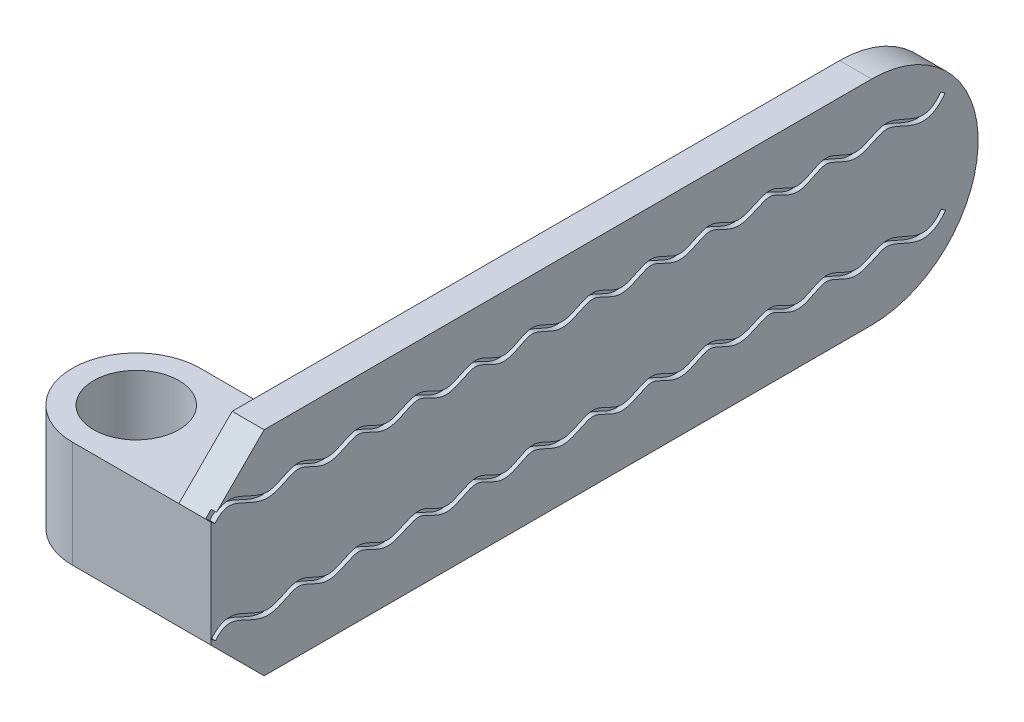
ISO-10303-21;
HEADER;
FILE_DESCRIPTION(('STEP AP214'),'2;1');
FILE_NAME('part.step','',(''),(''),'','','');
FILE_SCHEMA(('AUTOMOTIVE_DESIGN { 1 0 10303 214 1 1 1 1 }'));
ENDSEC;
DATA;
#1=APPLICATION_CONTEXT('core data for automotive mechanical design processes');
#2=APPLICATION_PROTOCOL_DEFINITION('international standard','automotive_design',2000,#1);
#3=PRODUCT_CONTEXT('',#1,'mechanical');
#4=PRODUCT('Part','Part','',(#3));
#5=PRODUCT_RELATED_PRODUCT_CATEGORY('part','',(#4));
#6=PRODUCT_DEFINITION_FORMATION('','',#4);
#7=PRODUCT_DEFINITION_CONTEXT('part definition',#1,'design');
#8=PRODUCT_DEFINITION('design','',#6,#7);
#9=PRODUCT_DEFINITION_SHAPE('','',#8);
#10=(LENGTH_UNIT() NAMED_UNIT(*) SI_UNIT(.MILLI.,.METRE.));
#11=(NAMED_UNIT(*) PLANE_ANGLE_UNIT() SI_UNIT($,.RADIAN.));
#12=(NAMED_UNIT(*) SI_UNIT($,.STERADIAN.) SOLID_ANGLE_UNIT());
#13=UNCERTAINTY_MEASURE_WITH_UNIT(LENGTH_MEASURE(1.E-05),#10,'distance_accuracy_value','');
#14=(GEOMETRIC_REPRESENTATION_CONTEXT(3) GLOBAL_UNCERTAINTY_ASSIGNED_CONTEXT((#13)) GLOBAL_UNIT_ASSIGNED_CONTEXT((#10,
#11,#12)) REPRESENTATION_CONTEXT('',''));
#15=CARTESIAN_POINT('',(0.,0.,0.));
#16=DIRECTION('',(0.,0.,1.));
#17=DIRECTION('',(1.,0.,0.));
#18=AXIS2_PLACEMENT_3D('',#15,#16,#17);
#19=CARTESIAN_POINT('',(-6.,40.,-24.));
#20=DIRECTION('',(0.,0.,1.));
#21=DIRECTION('',(1.,0.,0.));
#22=AXIS2_PLACEMENT_3D('',#19,#20,#21);
#23=PLANE('',#22);
#24=DIRECTION('',(0.,-1.,0.));
#25=VECTOR('',#24,1.);
#26=CARTESIAN_POINT('',(-26.,40.,-24.));
#27=LINE('',#26,#25);
#28=CARTESIAN_POINT('',(-26.,30.,-24.));
#29=VERTEX_POINT('',#28);
#30=CARTESIAN_POINT('',(-26.,10.,-24.));
#31=VERTEX_POINT('',#30);
#32=EDGE_CURVE('E384',#29,#31,#27,.T.);
#33=ORIENTED_EDGE('',*,*,#32,.F.);
#34=DIRECTION('',(1.,0.,0.));
#35=VECTOR('',#34,1.);
#36=CARTESIAN_POINT('',(-26.,30.,-24.));
#37=LINE('',#36,#35);
#38=CARTESIAN_POINT('',(-16.,30.,-24.));
#39=VERTEX_POINT('',#38);
#40=EDGE_CURVE('E330',#29,#39,#37,.T.);
#41=ORIENTED_EDGE('',*,*,#40,.T.);
#42=DIRECTION('',(0.,-1.,0.));
#43=VECTOR('',#42,1.);
#44=CARTESIAN_POINT('',(-16.,0.,-24.));
#45=LINE('',#44,#43);
#46=CARTESIAN_POINT('',(-16.,10.,-24.));
#47=VERTEX_POINT('',#46);
#48=EDGE_CURVE('E391',#39,#47,#45,.T.);
#49=ORIENTED_EDGE('',*,*,#48,.T.);
#50=DIRECTION('',(1.,0.,0.));
#51=VECTOR('',#50,1.);
#52=CARTESIAN_POINT('',(-26.,10.,-24.));
#53=LINE('',#52,#51);
#54=EDGE_CURVE('E342',#31,#47,#53,.T.);
#55=ORIENTED_EDGE('',*,*,#54,.F.);
#56=EDGE_LOOP('',(#33,#41,#49,#55));
#57=FACE_BOUND('',#56,.T.);
#58=ADVANCED_FACE('F76',(#57),#23,.F.);
#59=CARTESIAN_POINT('',(-26.,40.,-12.));
#60=DIRECTION('',(0.,-1.,0.));
#61=DIRECTION('',(0.,0.,-1.));
#62=AXIS2_PLACEMENT_3D('',#59,#60,#61);
#63=CYLINDRICAL_SURFACE('',#62,12.);
#64=DIRECTION('',(0.,-1.,0.));
#65=VECTOR('',#64,1.);
#66=CARTESIAN_POINT('',(-26.,40.,0.));
#67=LINE('',#66,#65);
#68=CARTESIAN_POINT('',(-26.,30.,0.));
#69=VERTEX_POINT('',#68);
#70=CARTESIAN_POINT('',(-26.,10.,0.));
#71=VERTEX_POINT('',#70);
#72=EDGE_CURVE('E375',#69,#71,#67,.T.);
#73=ORIENTED_EDGE('',*,*,#72,.F.);
#74=CARTESIAN_POINT('',(-26.,30.,-12.));
#75=DIRECTION('',(0.,-1.,0.));
#76=DIRECTION('',(0.,0.,-1.));
#77=AXIS2_PLACEMENT_3D('',#74,#75,#76);
#78=CIRCLE('',#77,12.);
#79=EDGE_CURVE('E326',#69,#29,#78,.T.);
#80=ORIENTED_EDGE('',*,*,#79,.T.);
#81=ORIENTED_EDGE('',*,*,#32,.T.);
#82=CARTESIAN_POINT('',(-26.,10.,-12.));
#83=DIRECTION('',(0.,-1.,0.));
#84=DIRECTION('',(0.,0.,-1.));
#85=AXIS2_PLACEMENT_3D('',#82,#83,#84);
#86=CIRCLE('',#85,12.);
#87=EDGE_CURVE('E338',#71,#31,#86,.T.);
#88=ORIENTED_EDGE('',*,*,#87,.F.);
#89=EDGE_LOOP('',(#73,#80,#81,#88));
#90=FACE_BOUND('',#89,.T.);
#91=ADVANCED_FACE('F478',(#90),#63,.T.);
#92=CARTESIAN_POINT('',(-26.,40.,-12.));
#93=DIRECTION('',(0.,-1.,0.));
#94=DIRECTION('',(0.,0.,-1.));
#95=AXIS2_PLACEMENT_3D('',#92,#93,#94);
#96=CYLINDRICAL_SURFACE('',#95,8.);
#97=CARTESIAN_POINT('',(-26.,30.,-12.));
#98=DIRECTION('',(0.,-1.,0.));
#99=DIRECTION('',(0.,0.,-1.));
#100=AXIS2_PLACEMENT_3D('',#97,#98,#99);
#101=CIRCLE('',#100,8.);
#102=CARTESIAN_POINT('',(-26.,30.,-20.));
#103=VERTEX_POINT('',#102);
#104=EDGE_CURVE('E334',#103,#103,#101,.T.);
#105=ORIENTED_EDGE('',*,*,#104,.F.);
#106=EDGE_LOOP('',(#105));
#107=FACE_BOUND('',#106,.T.);
#108=CARTESIAN_POINT('',(-26.,10.,-12.));
#109=DIRECTION('',(0.,-1.,0.));
#110=DIRECTION('',(0.,0.,-1.));
#111=AXIS2_PLACEMENT_3D('',#108,#109,#110);
#112=CIRCLE('',#111,8.);
#113=CARTESIAN_POINT('',(-26.,10.,-20.));
#114=VERTEX_POINT('',#113);
#115=EDGE_CURVE('E358',#114,#114,#112,.T.);
#116=ORIENTED_EDGE('',*,*,#115,.T.);
#117=EDGE_LOOP('',(#116));
#118=FACE_BOUND('',#117,.T.);
#119=ADVANCED_FACE('F474',(#107,#118),#96,.F.);
#120=CARTESIAN_POINT('',(-16.,40.,-34.));
#121=DIRECTION('',(0.,1.,0.));
#122=DIRECTION('',(0.,0.,1.));
#123=AXIS2_PLACEMENT_3D('',#120,#121,#122);
#124=CYLINDRICAL_SURFACE('',#123,10.);
#125=ORIENTED_EDGE('',*,*,#48,.F.);
#126=CARTESIAN_POINT('',(-16.,30.,-34.));
#127=DIRECTION('',(0.,1.,0.));
#128=DIRECTION('',(0.,0.,-1.));
#129=AXIS2_PLACEMENT_3D('',#126,#127,#128);
#130=CIRCLE('',#129,10.);
#131=CARTESIAN_POINT('',(-6.,30.,-34.));
#132=VERTEX_POINT('',#131);
#133=EDGE_CURVE('E309',#39,#132,#130,.T.);
#134=ORIENTED_EDGE('',*,*,#133,.T.);
#135=DIRECTION('',(0.,-1.,0.));
#136=VECTOR('',#135,1.);
#137=CARTESIAN_POINT('',(-6.,40.,-34.));
#138=LINE('',#137,#136);
#139=CARTESIAN_POINT('',(-6.,10.,-34.));
#140=VERTEX_POINT('',#139);
#141=EDGE_CURVE('E394',#140,#132,#138,.F.);
#142=ORIENTED_EDGE('',*,*,#141,.F.);
#143=CARTESIAN_POINT('',(-16.,10.,-34.));
#144=DIRECTION('',(0.,1.,0.));
#145=DIRECTION('',(0.,0.,-1.));
#146=AXIS2_PLACEMENT_3D('',#143,#144,#145);
#147=CIRCLE('',#146,10.);
#148=EDGE_CURVE('E346',#47,#140,#147,.T.);
#149=ORIENTED_EDGE('',*,*,#148,.F.);
#150=EDGE_LOOP('',(#125,#134,#142,#149));
#151=FACE_BOUND('',#150,.T.);
#152=ADVANCED_FACE('F477',(#151),#124,.F.);
#153=CARTESIAN_POINT('',(0.,40.,0.));
#154=DIRECTION('',(-1.,0.,0.));
#155=DIRECTION('',(0.,0.,1.));
#156=AXIS2_PLACEMENT_3D('',#153,#154,#155);
#157=PLANE('',#156);
#158=DIRECTION('',(0.,-0.629585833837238,-0.776930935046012));
#159=VECTOR('',#158,1.);
#160=CARTESIAN_POINT('',(0.,10.8987948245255,-0.088154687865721));
#161=LINE('',#160,#159);
#162=CARTESIAN_POINT('',(0.,10.8987948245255,-0.088154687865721));
#163=VERTEX_POINT('',#162);
#164=CARTESIAN_POINT('',(0.,10.2692089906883,-0.865085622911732));
#165=VERTEX_POINT('',#164);
#166=EDGE_CURVE('E718',#163,#165,#161,.T.);
#167=ORIENTED_EDGE('',*,*,#166,.F.);
#168=CARTESIAN_POINT('',(0.,12.3128925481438,-137.062167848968));
#169=CARTESIAN_POINT('',(0.,7.46082744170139,-133.604907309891));
#170=CARTESIAN_POINT('',(0.,15.3223703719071,-128.200325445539));
#171=CARTESIAN_POINT('',(0.,8.80038936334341,-121.008330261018));
#172=CARTESIAN_POINT('',(0.,14.1144445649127,-115.502929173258));
#173=CARTESIAN_POINT('',(0.,8.84802205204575,-110.190690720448));
#174=CARTESIAN_POINT('',(0.,14.1299681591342,-104.869747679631));
#175=CARTESIAN_POINT('',(0.,8.64880085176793,-99.2468795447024));
#176=CARTESIAN_POINT('',(0.,14.0834757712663,-93.5989872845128));
#177=CARTESIAN_POINT('',(0.,8.7688813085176,-88.1303986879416));
#178=CARTESIAN_POINT('',(0.,14.1053530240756,-82.6698466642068));
#179=CARTESIAN_POINT('',(0.,8.75080893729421,-77.1856176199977));
#180=CARTESIAN_POINT('',(0.,14.0792767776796,-71.6823253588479));
#181=CARTESIAN_POINT('',(0.,8.65573926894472,-66.0374559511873));
#182=CARTESIAN_POINT('',(0.,14.114622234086,-60.4103582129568));
#183=CARTESIAN_POINT('',(0.,8.82676360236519,-55.0569089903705));
#184=CARTESIAN_POINT('',(0.,14.1472966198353,-49.7218409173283));
#185=CARTESIAN_POINT('',(0.,8.76472128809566,-44.305547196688));
#186=CARTESIAN_POINT('',(0.,14.1155939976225,-38.8620535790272));
#187=CARTESIAN_POINT('',(0.,8.69246818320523,-33.2947132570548));
#188=CARTESIAN_POINT('',(0.,14.0669649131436,-27.6993826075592));
#189=CARTESIAN_POINT('',(0.,8.72601386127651,-22.1140222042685));
#190=CARTESIAN_POINT('',(0.,13.9998399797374,-16.537601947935));
#191=CARTESIAN_POINT('',(0.,7.46879667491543,-9.25427649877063));
#192=CARTESIAN_POINT('',(0.,15.5433818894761,-3.85189492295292));
#193=CARTESIAN_POINT('',(0.,10.8987948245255,-0.088154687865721));
#194=B_SPLINE_CURVE_WITH_KNOTS('',3,(#168,#169,#170,#171,#172,#173,#174,#175,#176,#177,#178,
#179,#180,#181,#182,#183,#184,#185,#186,#187,#188,#189,#190,#191,#192,#193),.UNSPECIFIED.,.F.,
.F.,(4,1,1,1,1,1,1,1,1,1,1,1,1,1,1,1,1,1,1,1,1,1,1,4),(0.,0.0775700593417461,0.1170287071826,
0.158493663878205,0.197356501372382,0.233544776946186,0.277722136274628,0.31785330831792,
0.358045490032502,0.397091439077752,0.43837211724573,0.477174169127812,0.518700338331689,
0.561474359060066,0.599041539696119,0.63735632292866,0.679373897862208,0.71577556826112,
0.759735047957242,0.798400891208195,0.840064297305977,0.881009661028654,0.920389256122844,1.),.UNSPECIFIED.);
#195=CARTESIAN_POINT('',(0.,12.3128925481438,-137.062167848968));
#196=VERTEX_POINT('',#195);
#197=EDGE_CURVE('E93',#196,#163,#194,.T.);
#198=ORIENTED_EDGE('',*,*,#197,.F.);
#199=DIRECTION('',(0.,0.580293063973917,0.814407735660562));
#200=VECTOR('',#199,1.);
#201=CARTESIAN_POINT('',(0.,11.7325994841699,-137.876575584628));
#202=LINE('',#201,#200);
#203=CARTESIAN_POINT('',(0.,11.7325994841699,-137.876575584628));
#204=VERTEX_POINT('',#203);
#205=EDGE_CURVE('E229',#204,#196,#202,.T.);
#206=ORIENTED_EDGE('',*,*,#205,.F.);
#207=CARTESIAN_POINT('',(0.,10.2692089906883,-0.865085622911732));
#208=CARTESIAN_POINT('',(0.,10.3657410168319,-0.943310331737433));
#209=CARTESIAN_POINT('',(0.,10.5606071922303,-1.10973058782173));
#210=CARTESIAN_POINT('',(0.,10.8865642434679,-1.42212815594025));
#211=CARTESIAN_POINT('',(0.,11.2132826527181,-1.80027001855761));
#212=CARTESIAN_POINT('',(0.,11.4852086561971,-2.22369275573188));
#213=CARTESIAN_POINT('',(0.,11.7204056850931,-2.75639805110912));
#214=CARTESIAN_POINT('',(0.,11.8299857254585,-3.39256963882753));
#215=CARTESIAN_POINT('',(0.,11.73967467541,-4.23051539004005));
#216=CARTESIAN_POINT('',(0.,11.441420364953,-5.16837684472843));
#217=CARTESIAN_POINT('',(0.,10.8421480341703,-6.51920931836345));
#218=CARTESIAN_POINT('',(0.,10.0967728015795,-7.98354584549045));
#219=CARTESIAN_POINT('',(0.,9.58479747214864,-9.59564125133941));
#220=CARTESIAN_POINT('',(0.,9.44198890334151,-10.9306221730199));
#221=CARTESIAN_POINT('',(0.,9.72933823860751,-12.2863903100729));
#222=CARTESIAN_POINT('',(0.,10.2269733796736,-13.4479398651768));
#223=CARTESIAN_POINT('',(0.,10.7528057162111,-14.5213989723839));
#224=CARTESIAN_POINT('',(0.,11.1672893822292,-15.4930988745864));
#225=CARTESIAN_POINT('',(0.,11.3202278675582,-16.1846431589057));
#226=CARTESIAN_POINT('',(0.,11.312725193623,-16.6498395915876));
#227=CARTESIAN_POINT('',(0.,11.219671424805,-17.1824308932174));
#228=CARTESIAN_POINT('',(0.,10.9413912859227,-17.9507984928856));
#229=CARTESIAN_POINT('',(0.,10.4382504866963,-18.9904949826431));
#230=CARTESIAN_POINT('',(0.,9.91402200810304,-20.1290582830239));
#231=CARTESIAN_POINT('',(0.,9.51000250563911,-21.3957841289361));
#232=CARTESIAN_POINT('',(0.,9.52655758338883,-22.8600410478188));
#233=CARTESIAN_POINT('',(0.,9.94333889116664,-24.1158763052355));
#234=CARTESIAN_POINT('',(0.,10.4706466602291,-25.2533951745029));
#235=CARTESIAN_POINT('',(0.,10.9684292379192,-26.2866593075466));
#236=CARTESIAN_POINT('',(0.,11.2880241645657,-27.21731100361));
#237=CARTESIAN_POINT('',(0.,11.34945677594,-27.907282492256));
#238=CARTESIAN_POINT('',(0.,11.1414647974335,-28.7136899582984));
#239=CARTESIAN_POINT('',(0.,10.6904238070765,-29.6958105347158));
#240=CARTESIAN_POINT('',(0.,10.1383479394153,-30.7786827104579));
#241=CARTESIAN_POINT('',(0.,9.72989405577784,-31.7863450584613));
#242=CARTESIAN_POINT('',(0.,9.53894451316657,-32.6821863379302));
#243=CARTESIAN_POINT('',(0.,9.50242818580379,-33.651532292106));
#244=CARTESIAN_POINT('',(0.,9.75272149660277,-34.755588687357));
#245=CARTESIAN_POINT('',(0.,10.2460397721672,-35.9402930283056));
#246=CARTESIAN_POINT('',(0.,10.770137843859,-37.0260934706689));
#247=CARTESIAN_POINT('',(0.,11.181175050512,-38.0129521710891));
#248=CARTESIAN_POINT('',(0.,11.3587903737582,-38.8444200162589));
#249=CARTESIAN_POINT('',(0.,11.2794880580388,-39.5092934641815));
#250=CARTESIAN_POINT('',(0.,10.9079882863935,-40.4278476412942));
#251=CARTESIAN_POINT('',(0.,10.3556709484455,-41.4603648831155));
#252=CARTESIAN_POINT('',(0.,9.7998860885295,-42.606452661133));
#253=CARTESIAN_POINT('',(0.,9.49983230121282,-43.7366820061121));
#254=CARTESIAN_POINT('',(0.,9.53716451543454,-44.7084615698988));
#255=CARTESIAN_POINT('',(0.,9.72107227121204,-45.5975292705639));
#256=CARTESIAN_POINT('',(0.,10.1206565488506,-46.6102907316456));
#257=CARTESIAN_POINT('',(0.,10.6664455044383,-47.7100607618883));
#258=CARTESIAN_POINT('',(0.,11.1219292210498,-48.7111722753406));
#259=CARTESIAN_POINT('',(0.,11.3453511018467,-49.564980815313));
#260=CARTESIAN_POINT('',(0.,11.3004493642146,-50.2222101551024));
#261=CARTESIAN_POINT('',(0.,10.9680582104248,-51.1307974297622));
#262=CARTESIAN_POINT('',(0.,10.4367903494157,-52.1565418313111));
#263=CARTESIAN_POINT('',(0.,9.87887178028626,-53.2950820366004));
#264=CARTESIAN_POINT('',(0.,9.542623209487,-54.3701497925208));
#265=CARTESIAN_POINT('',(0.,9.51454506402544,-55.3570281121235));
#266=CARTESIAN_POINT('',(0.,9.67586430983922,-56.2809935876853));
#267=CARTESIAN_POINT('',(0.,10.0824758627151,-57.3023255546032));
#268=CARTESIAN_POINT('',(0.,10.6541445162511,-58.3935463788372));
#269=CARTESIAN_POINT('',(0.,11.130956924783,-59.3784507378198));
#270=CARTESIAN_POINT('',(0.,11.3172668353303,-60.0574333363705));
#271=CARTESIAN_POINT('',(0.,11.3232754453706,-60.5090100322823));
#272=CARTESIAN_POINT('',(0.,11.2463075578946,-61.0362385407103));
#273=CARTESIAN_POINT('',(0.,10.9862405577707,-61.7977868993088));
#274=CARTESIAN_POINT('',(0.,10.4950672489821,-62.8340524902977));
#275=CARTESIAN_POINT('',(0.,9.9679558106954,-63.9688330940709));
#276=CARTESIAN_POINT('',(0.,9.54405659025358,-65.2152548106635));
#277=CARTESIAN_POINT('',(0.,9.49502307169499,-66.677626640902));
#278=CARTESIAN_POINT('',(0.,9.88684630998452,-67.9617358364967));
#279=CARTESIAN_POINT('',(0.,10.4096636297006,-69.107951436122));
#280=CARTESIAN_POINT('',(0.,10.9195098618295,-70.1556221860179));
#281=CARTESIAN_POINT('',(0.,11.2083384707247,-70.9294175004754));
#282=CARTESIAN_POINT('',(0.,11.3099462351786,-71.4689482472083));
#283=CARTESIAN_POINT('',(0.,11.3262996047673,-71.9282694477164));
#284=CARTESIAN_POINT('',(0.,11.1770791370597,-72.5858844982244));
#285=CARTESIAN_POINT('',(0.,10.7430428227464,-73.5567774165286));
#286=CARTESIAN_POINT('',(0.,10.1913312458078,-74.6308639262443));
#287=CARTESIAN_POINT('',(0.,9.76954474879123,-75.6282849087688));
#288=CARTESIAN_POINT('',(0.,9.55842932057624,-76.5101031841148));
#289=CARTESIAN_POINT('',(0.,9.48975561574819,-77.4790288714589));
#290=CARTESIAN_POINT('',(0.,9.73334992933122,-78.6079546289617));
#291=CARTESIAN_POINT('',(0.,10.2383100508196,-79.7883647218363));
#292=CARTESIAN_POINT('',(0.,10.775750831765,-80.8660256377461));
#293=CARTESIAN_POINT('',(0.,11.1903283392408,-81.8384511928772));
#294=CARTESIAN_POINT('',(0.,11.328442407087,-82.5103504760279));
#295=CARTESIAN_POINT('',(0.,11.305513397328,-82.9625242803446));
#296=CARTESIAN_POINT('',(0.,11.1921664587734,-83.496372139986));
#297=CARTESIAN_POINT('',(0.,10.8799805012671,-84.2698547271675));
#298=CARTESIAN_POINT('',(0.,10.3429144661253,-85.319715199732));
#299=CARTESIAN_POINT('',(0.,9.80781190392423,-86.4754902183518));
#300=CARTESIAN_POINT('',(0.,9.51309339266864,-87.5800238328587));
#301=CARTESIAN_POINT('',(0.,9.53152584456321,-88.5569757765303));
#302=CARTESIAN_POINT('',(0.,9.70797730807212,-89.4545813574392));
#303=CARTESIAN_POINT('',(0.,10.1053890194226,-90.4705138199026));
#304=CARTESIAN_POINT('',(0.,10.6547164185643,-91.5670918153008));
#305=CARTESIAN_POINT('',(0.,11.1153914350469,-92.5638681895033));
#306=CARTESIAN_POINT('',(0.,11.343072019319,-93.4036199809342));
#307=CARTESIAN_POINT('',(0.,11.2999567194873,-94.0737465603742));
#308=CARTESIAN_POINT('',(0.,10.9909305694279,-94.9847808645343));
#309=CARTESIAN_POINT('',(0.,10.4903734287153,-96.006417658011));
#310=CARTESIAN_POINT('',(0.,9.95290598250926,-97.1354182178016));
#311=CARTESIAN_POINT('',(0.,9.5239601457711,-98.3956707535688));
#312=CARTESIAN_POINT('',(0.,9.510303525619,-99.8619369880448));
#313=CARTESIAN_POINT('',(0.,9.90295160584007,-101.129233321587));
#314=CARTESIAN_POINT('',(0.,10.4186359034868,-102.281501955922));
#315=CARTESIAN_POINT('',(0.,10.9210740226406,-103.336439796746));
#316=CARTESIAN_POINT('',(0.,11.2675982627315,-104.285936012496));
#317=CARTESIAN_POINT('',(0.,11.3480421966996,-104.924373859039));
#318=CARTESIAN_POINT('',(0.,11.2837715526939,-105.383145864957));
#319=CARTESIAN_POINT('',(0.,11.1202956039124,-105.934775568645));
#320=CARTESIAN_POINT('',(0.,10.7447932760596,-106.727284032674));
#321=CARTESIAN_POINT('',(0.,10.1652962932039,-107.79737736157));
#322=CARTESIAN_POINT('',(0.,9.73030520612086,-108.799778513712));
#323=CARTESIAN_POINT('',(0.,9.53115102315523,-109.707629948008));
#324=CARTESIAN_POINT('',(0.,9.51190935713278,-110.699091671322));
#325=CARTESIAN_POINT('',(0.,9.81605574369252,-111.795673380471));
#326=CARTESIAN_POINT('',(0.,10.3607562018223,-112.950741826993));
#327=CARTESIAN_POINT('',(0.,10.9023282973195,-113.993570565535));
#328=CARTESIAN_POINT('',(0.,11.2705747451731,-114.932506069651));
#329=CARTESIAN_POINT('',(0.,11.3552635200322,-115.614617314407));
#330=CARTESIAN_POINT('',(0.,11.1754772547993,-116.42971873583));
#331=CARTESIAN_POINT('',(0.,10.7557013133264,-117.409999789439));
#332=CARTESIAN_POINT('',(0.,10.2216928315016,-118.491737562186));
#333=CARTESIAN_POINT('',(0.,9.72422207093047,-119.667803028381));
#334=CARTESIAN_POINT('',(0.,9.44343897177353,-121.04406927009));
#335=CARTESIAN_POINT('',(0.,9.67452953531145,-122.43863222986));
#336=CARTESIAN_POINT('',(0.,10.1513695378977,-123.62338277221));
#337=CARTESIAN_POINT('',(0.,10.6840995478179,-124.711181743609));
#338=CARTESIAN_POINT('',(0.,11.1288235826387,-125.70583381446));
#339=CARTESIAN_POINT('',(0.,11.3538623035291,-126.541375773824));
#340=CARTESIAN_POINT('',(0.,11.3270501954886,-127.298063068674));
#341=CARTESIAN_POINT('',(0.,11.0887485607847,-128.21152874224));
#342=CARTESIAN_POINT('',(0.,10.6771496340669,-129.206161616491));
#343=CARTESIAN_POINT('',(0.,10.0135691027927,-130.62801369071));
#344=CARTESIAN_POINT('',(0.,9.35196959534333,-132.174062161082));
#345=CARTESIAN_POINT('',(0.,9.16957668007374,-133.94130992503));
#346=CARTESIAN_POINT('',(0.,9.46239161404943,-135.348787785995));
#347=CARTESIAN_POINT('',(0.,10.1565687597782,-136.466684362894));
#348=CARTESIAN_POINT('',(0.,10.9593087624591,-137.284440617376));
#349=CARTESIAN_POINT('',(0.,11.4742401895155,-137.692485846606));
#350=CARTESIAN_POINT('',(0.,11.7325994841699,-137.876575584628));
#351=B_SPLINE_CURVE_WITH_KNOTS('',3,(#207,#208,#209,#210,#211,#212,#213,#214,#215,#216,#217,
#218,#219,#220,#221,#222,#223,#224,#225,#226,#227,#228,#229,#230,#231,#232,#233,#234,#235,#236,
#237,#238,#239,#240,#241,#242,#243,#244,#245,#246,#247,#248,#249,#250,#251,#252,#253,#254,#255,
#256,#257,#258,#259,#260,#261,#262,#263,#264,#265,#266,#267,#268,#269,#270,#271,#272,#273,#274,
#275,#276,#277,#278,#279,#280,#281,#282,#283,#284,#285,#286,#287,#288,#289,#290,#291,#292,#293,
#294,#295,#296,#297,#298,#299,#300,#301,#302,#303,#304,#305,#306,#307,#308,#309,#310,#311,#312,
#313,#314,#315,#316,#317,#318,#319,#320,#321,#322,#323,#324,#325,#326,#327,#328,#329,#330,#331,
#332,#333,#334,#335,#336,#337,#338,#339,#340,#341,#342,#343,#344,#345,#346,#347,#348,#349,#350),
.UNSPECIFIED.,.F.,.F.,(4,1,1,1,1,1,1,1,1,1,1,1,1,1,1,1,1,1,1,1,1,1,1,1,1,1,1,1,1,1,1,1,1,1,1,1,
1,1,1,1,1,1,1,1,1,1,1,1,1,1,1,1,1,1,1,1,1,1,1,1,1,1,1,1,1,1,1,1,1,1,1,1,1,1,1,1,1,1,1,1,1,1,1,1,
1,1,1,1,1,1,1,1,1,1,1,1,1,1,1,1,1,1,1,1,1,1,1,1,1,1,1,1,1,1,1,1,1,1,1,1,1,1,1,1,1,1,1,1,1,1,1,1,
1,1,1,1,1,1,1,1,1,4),(0.,0.001953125,0.00390625,0.0078125,0.01171875,0.015625,0.0234375,0.03125,
0.0390625,0.046875,0.0625,0.0703125,0.078125,0.0859375,0.09375,0.1015625,0.109375,0.1171875,
0.12109375,0.125,0.1328125,0.140625,0.1484375,0.15625,0.1640625,0.171875,0.1796875,0.1875,
0.1953125,0.203125,0.2109375,0.21875,0.2265625,0.234375,0.23828125,0.2421875,0.25,0.2578125,
0.265625,0.2734375,0.28125,0.2890625,0.296875,0.3046875,0.3125,0.3203125,0.32421875,0.328125,
0.3359375,0.34375,0.3515625,0.359375,0.3671875,0.375,0.3828125,0.390625,0.3984375,0.40234375,
0.40625,0.4140625,0.421875,0.4296875,0.4375,0.44140625,0.4453125,0.453125,0.4609375,0.46875,
0.4765625,0.484375,0.4921875,0.5,0.5078125,0.515625,0.51953125,0.5234375,0.53125,0.5390625,
0.546875,0.5546875,0.55859375,0.5625,0.5703125,0.578125,0.5859375,0.59375,0.6015625,0.60546875,
0.609375,0.6171875,0.625,0.6328125,0.640625,0.64453125,0.6484375,0.65625,0.6640625,0.671875,
0.6796875,0.6875,0.6953125,0.703125,0.7109375,0.71875,0.7265625,0.734375,0.7421875,0.75,
0.7578125,0.765625,0.76953125,0.7734375,0.78125,0.7890625,0.796875,0.80078125,0.8046875,0.8125,
0.8203125,0.828125,0.8359375,0.84375,0.8515625,0.859375,0.8671875,0.875,0.8828125,0.890625,
0.8984375,0.90625,0.9140625,0.921875,0.9296875,0.9375,0.9453125,0.953125,0.96875,0.9765625,
0.984375,0.9921875,0.99609375,1.),.UNSPECIFIED.);
#352=EDGE_CURVE('E233',#165,#204,#351,.T.);
#353=ORIENTED_EDGE('',*,*,#352,.F.);
#354=EDGE_LOOP('',(#167,#198,#206,#353));
#355=FACE_BOUND('',#354,.T.);
#356=CARTESIAN_POINT('',(0.,29.3704141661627,-0.776930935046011));
#357=CARTESIAN_POINT('',(0.,29.4669461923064,-0.855155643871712));
#358=CARTESIAN_POINT('',(0.,29.6618123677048,-1.02157589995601));
#359=CARTESIAN_POINT('',(0.,29.9877694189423,-1.33397346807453));
#360=CARTESIAN_POINT('',(0.,30.3144878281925,-1.71211533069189));
#361=CARTESIAN_POINT('',(0.,30.5864138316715,-2.13553806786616));
#362=CARTESIAN_POINT('',(0.,30.8216108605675,-2.6682433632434));
#363=CARTESIAN_POINT('',(0.,30.931190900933,-3.30441495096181));
#364=CARTESIAN_POINT('',(0.,30.8408798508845,-4.14236070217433));
#365=CARTESIAN_POINT('',(0.,30.5426255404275,-5.08022215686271));
#366=CARTESIAN_POINT('',(0.,29.9433532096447,-6.43105463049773));
#367=CARTESIAN_POINT('',(0.,29.1979779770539,-7.89539115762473));
#368=CARTESIAN_POINT('',(0.,28.6860026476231,-9.50748656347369));
#369=CARTESIAN_POINT('',(0.,28.543194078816,-10.8424674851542));
#370=CARTESIAN_POINT('',(0.,28.830543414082,-12.1982356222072));
#371=CARTESIAN_POINT('',(0.,29.328178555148,-13.3597851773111));
#372=CARTESIAN_POINT('',(0.,29.8540108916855,-14.4332442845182));
#373=CARTESIAN_POINT('',(0.,30.2684945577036,-15.4049441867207));
#374=CARTESIAN_POINT('',(0.,30.4214330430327,-16.09648847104));
#375=CARTESIAN_POINT('',(0.,30.4139303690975,-16.5616849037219));
#376=CARTESIAN_POINT('',(0.,30.3208766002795,-17.0942762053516));
#377=CARTESIAN_POINT('',(0.,30.0425964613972,-17.8626438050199));
#378=CARTESIAN_POINT('',(0.,29.5394556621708,-18.9023402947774));
#379=CARTESIAN_POINT('',(0.,29.0152271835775,-20.0409035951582));
#380=CARTESIAN_POINT('',(0.,28.6112076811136,-21.3076294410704));
#381=CARTESIAN_POINT('',(0.,28.6277627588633,-22.771886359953));
#382=CARTESIAN_POINT('',(0.,29.0445440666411,-24.0277216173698));
#383=CARTESIAN_POINT('',(0.,29.5718518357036,-25.1652404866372));
#384=CARTESIAN_POINT('',(0.,30.0696344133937,-26.1985046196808));
#385=CARTESIAN_POINT('',(0.,30.3892293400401,-27.1291563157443));
#386=CARTESIAN_POINT('',(0.,30.4506619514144,-27.8191278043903));
#387=CARTESIAN_POINT('',(0.,30.2426699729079,-28.6255352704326));
#388=CARTESIAN_POINT('',(0.,29.7916289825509,-29.60765584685));
#389=CARTESIAN_POINT('',(0.,29.2395531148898,-30.6905280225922));
#390=CARTESIAN_POINT('',(0.,28.8310992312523,-31.6981903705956));
#391=CARTESIAN_POINT('',(0.,28.640149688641,-32.5940316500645));
#392=CARTESIAN_POINT('',(0.,28.6036333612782,-33.5633776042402));
#393=CARTESIAN_POINT('',(0.,28.8539266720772,-34.6674339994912));
#394=CARTESIAN_POINT('',(0.,29.3472449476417,-35.8521383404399));
#395=CARTESIAN_POINT('',(0.,29.8713430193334,-36.9379387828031));
#396=CARTESIAN_POINT('',(0.,30.2823802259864,-37.9247974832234));
#397=CARTESIAN_POINT('',(0.,30.4599955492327,-38.7562653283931));
#398=CARTESIAN_POINT('',(0.,30.3806932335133,-39.4211387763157));
#399=CARTESIAN_POINT('',(0.,30.0091934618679,-40.3396929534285));
#400=CARTESIAN_POINT('',(0.,29.4568761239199,-41.3722101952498));
#401=CARTESIAN_POINT('',(0.,28.9010912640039,-42.5182979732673));
#402=CARTESIAN_POINT('',(0.,28.6010374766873,-43.6485273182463));
#403=CARTESIAN_POINT('',(0.,28.638369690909,-44.6203068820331));
#404=CARTESIAN_POINT('',(0.,28.8222774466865,-45.5093745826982));
#405=CARTESIAN_POINT('',(0.,29.221861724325,-46.5221360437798));
#406=CARTESIAN_POINT('',(0.,29.7676506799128,-47.6219060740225));
#407=CARTESIAN_POINT('',(0.,30.2231343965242,-48.6230175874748));
#408=CARTESIAN_POINT('',(0.,30.4465562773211,-49.4768261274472));
#409=CARTESIAN_POINT('',(0.,30.401654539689,-50.1340554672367));
#410=CARTESIAN_POINT('',(0.,30.0692633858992,-51.0426427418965));
#411=CARTESIAN_POINT('',(0.,29.5379955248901,-52.0683871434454));
#412=CARTESIAN_POINT('',(0.,28.9800769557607,-53.2069273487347));
#413=CARTESIAN_POINT('',(0.,28.6438283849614,-54.2819951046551));
#414=CARTESIAN_POINT('',(0.,28.6157502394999,-55.2688734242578));
#415=CARTESIAN_POINT('',(0.,28.7770694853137,-56.1928388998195));
#416=CARTESIAN_POINT('',(0.,29.1836810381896,-57.2141708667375));
#417=CARTESIAN_POINT('',(0.,29.7553496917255,-58.3053916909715));
#418=CARTESIAN_POINT('',(0.,30.2321621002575,-59.2902960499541));
#419=CARTESIAN_POINT('',(0.,30.4184720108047,-59.9692786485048));
#420=CARTESIAN_POINT('',(0.,30.4244806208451,-60.4208553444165));
#421=CARTESIAN_POINT('',(0.,30.347512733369,-60.9480838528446));
#422=CARTESIAN_POINT('',(0.,30.0874457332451,-61.7096322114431));
#423=CARTESIAN_POINT('',(0.,29.5962724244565,-62.745897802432));
#424=CARTESIAN_POINT('',(0.,29.0691609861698,-63.8806784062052));
#425=CARTESIAN_POINT('',(0.,28.645261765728,-65.1271001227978));
#426=CARTESIAN_POINT('',(0.,28.5962282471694,-66.5894719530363));
#427=CARTESIAN_POINT('',(0.,28.988051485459,-67.873581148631));
#428=CARTESIAN_POINT('',(0.,29.510868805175,-69.0197967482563));
#429=CARTESIAN_POINT('',(0.,30.0207150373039,-70.0674674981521));
#430=CARTESIAN_POINT('',(0.,30.3095436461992,-70.8412628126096));
#431=CARTESIAN_POINT('',(0.,30.4111514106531,-71.3807935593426));
#432=CARTESIAN_POINT('',(0.,30.4275047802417,-71.8401147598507));
#433=CARTESIAN_POINT('',(0.,30.2782843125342,-72.4977298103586));
#434=CARTESIAN_POINT('',(0.,29.8442479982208,-73.4686227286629));
#435=CARTESIAN_POINT('',(0.,29.2925364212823,-74.5427092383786));
#436=CARTESIAN_POINT('',(0.,28.8707499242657,-75.5401302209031));
#437=CARTESIAN_POINT('',(0.,28.6596344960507,-76.4219484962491));
#438=CARTESIAN_POINT('',(0.,28.5909607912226,-77.3908741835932));
#439=CARTESIAN_POINT('',(0.,28.8345551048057,-78.519799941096));
#440=CARTESIAN_POINT('',(0.,29.3395152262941,-79.7002100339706));
#441=CARTESIAN_POINT('',(0.,29.8769560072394,-80.7778709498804));
#442=CARTESIAN_POINT('',(0.,30.2915335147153,-81.7502965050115));
#443=CARTESIAN_POINT('',(0.,30.4296475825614,-82.4221957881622));
#444=CARTESIAN_POINT('',(0.,30.4067185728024,-82.8743695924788));
#445=CARTESIAN_POINT('',(0.,30.2933716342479,-83.4082174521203));
#446=CARTESIAN_POINT('',(0.,29.9811856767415,-84.1817000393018));
#447=CARTESIAN_POINT('',(0.,29.4441196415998,-85.2315605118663));
#448=CARTESIAN_POINT('',(0.,28.9090170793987,-86.3873355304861));
#449=CARTESIAN_POINT('',(0.,28.6142985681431,-87.491869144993));
#450=CARTESIAN_POINT('',(0.,28.6327310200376,-88.4688210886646));
#451=CARTESIAN_POINT('',(0.,28.8091824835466,-89.3664266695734));
#452=CARTESIAN_POINT('',(0.,29.2065941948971,-90.3823591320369));
#453=CARTESIAN_POINT('',(0.,29.7559215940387,-91.4789371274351));
#454=CARTESIAN_POINT('',(0.,30.2165966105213,-92.4757135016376));
#455=CARTESIAN_POINT('',(0.,30.4442771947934,-93.3154652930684));
#456=CARTESIAN_POINT('',(0.,30.4011618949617,-93.9855918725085));
#457=CARTESIAN_POINT('',(0.,30.0921357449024,-94.8966261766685));
#458=CARTESIAN_POINT('',(0.,29.5915786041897,-95.9182629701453));
#459=CARTESIAN_POINT('',(0.,29.0541111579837,-97.0472635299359));
#460=CARTESIAN_POINT('',(0.,28.6251653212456,-98.3075160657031));
#461=CARTESIAN_POINT('',(0.,28.6115087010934,-99.7737823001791));
#462=CARTESIAN_POINT('',(0.,29.0041567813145,-101.041078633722));
#463=CARTESIAN_POINT('',(0.,29.5198410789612,-102.193347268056));
#464=CARTESIAN_POINT('',(0.,30.022279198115,-103.24828510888));
#465=CARTESIAN_POINT('',(0.,30.368803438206,-104.19778132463));
#466=CARTESIAN_POINT('',(0.,30.4492473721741,-104.836219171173));
#467=CARTESIAN_POINT('',(0.,30.3849767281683,-105.294991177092));
#468=CARTESIAN_POINT('',(0.,30.2215007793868,-105.84662088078));
#469=CARTESIAN_POINT('',(0.,29.8459984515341,-106.639129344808));
#470=CARTESIAN_POINT('',(0.,29.2665014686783,-107.709222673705));
#471=CARTESIAN_POINT('',(0.,28.8315103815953,-108.711623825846));
#472=CARTESIAN_POINT('',(0.,28.6323561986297,-109.619475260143));
#473=CARTESIAN_POINT('',(0.,28.6131145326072,-110.610936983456));
#474=CARTESIAN_POINT('',(0.,28.917260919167,-111.707518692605));
#475=CARTESIAN_POINT('',(0.,29.4619613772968,-112.862587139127));
#476=CARTESIAN_POINT('',(0.,30.003533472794,-113.905415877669));
#477=CARTESIAN_POINT('',(0.,30.3717799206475,-114.844351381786));
#478=CARTESIAN_POINT('',(0.,30.4564686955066,-115.526462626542));
#479=CARTESIAN_POINT('',(0.,30.2766824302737,-116.341564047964));
#480=CARTESIAN_POINT('',(0.,29.8569064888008,-117.321845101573));
#481=CARTESIAN_POINT('',(0.,29.3228980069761,-118.403582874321));
#482=CARTESIAN_POINT('',(0.,28.8254272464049,-119.579648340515));
#483=CARTESIAN_POINT('',(0.,28.544644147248,-120.955914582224));
#484=CARTESIAN_POINT('',(0.,28.7757347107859,-122.350477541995));
#485=CARTESIAN_POINT('',(0.,29.2525747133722,-123.535228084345));
#486=CARTESIAN_POINT('',(0.,29.7853047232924,-124.623027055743));
#487=CARTESIAN_POINT('',(0.,30.2300287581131,-125.617679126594));
#488=CARTESIAN_POINT('',(0.,30.4550674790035,-126.453221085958));
#489=CARTESIAN_POINT('',(0.,30.4282553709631,-127.209908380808));
#490=CARTESIAN_POINT('',(0.,30.1899537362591,-128.123374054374));
#491=CARTESIAN_POINT('',(0.,29.7783548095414,-129.118006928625));
#492=CARTESIAN_POINT('',(0.,29.1147742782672,-130.539859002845));
#493=CARTESIAN_POINT('',(0.,28.4531747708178,-132.085907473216));
#494=CARTESIAN_POINT('',(0.,28.2707818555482,-133.853155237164));
#495=CARTESIAN_POINT('',(0.,28.5635967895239,-135.260633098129));
#496=CARTESIAN_POINT('',(0.,29.2577739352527,-136.378529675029));
#497=CARTESIAN_POINT('',(0.,30.0605139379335,-137.19628592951));
#498=CARTESIAN_POINT('',(0.,30.5754453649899,-137.60433115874));
#499=CARTESIAN_POINT('',(0.,30.8338046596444,-137.788420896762));
#500=B_SPLINE_CURVE_WITH_KNOTS('',3,(#356,#357,#358,#359,#360,#361,#362,#363,#364,#365,#366,
#367,#368,#369,#370,#371,#372,#373,#374,#375,#376,#377,#378,#379,#380,#381,#382,#383,#384,#385,
#386,#387,#388,#389,#390,#391,#392,#393,#394,#395,#396,#397,#398,#399,#400,#401,#402,#403,#404,
#405,#406,#407,#408,#409,#410,#411,#412,#413,#414,#415,#416,#417,#418,#419,#420,#421,#422,#423,
#424,#425,#426,#427,#428,#429,#430,#431,#432,#433,#434,#435,#436,#437,#438,#439,#440,#441,#442,
#443,#444,#445,#446,#447,#448,#449,#450,#451,#452,#453,#454,#455,#456,#457,#458,#459,#460,#461,
#462,#463,#464,#465,#466,#467,#468,#469,#470,#471,#472,#473,#474,#475,#476,#477,#478,#479,#480,
#481,#482,#483,#484,#485,#486,#487,#488,#489,#490,#491,#492,#493,#494,#495,#496,#497,#498,#499),
.UNSPECIFIED.,.F.,.F.,(4,1,1,1,1,1,1,1,1,1,1,1,1,1,1,1,1,1,1,1,1,1,1,1,1,1,1,1,1,1,1,1,1,1,1,1,
1,1,1,1,1,1,1,1,1,1,1,1,1,1,1,1,1,1,1,1,1,1,1,1,1,1,1,1,1,1,1,1,1,1,1,1,1,1,1,1,1,1,1,1,1,1,1,1,
1,1,1,1,1,1,1,1,1,1,1,1,1,1,1,1,1,1,1,1,1,1,1,1,1,1,1,1,1,1,1,1,1,1,1,1,1,1,1,1,1,1,1,1,1,1,1,1,
1,1,1,1,1,1,1,1,1,4),(0.,0.001953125,0.00390625,0.0078125,0.01171875,0.015625,0.0234375,0.03125,
0.0390625,0.046875,0.0625,0.0703125,0.078125,0.0859375,0.09375,0.1015625,0.109375,0.1171875,
0.12109375,0.125,0.1328125,0.140625,0.1484375,0.15625,0.1640625,0.171875,0.1796875,0.1875,
0.1953125,0.203125,0.2109375,0.21875,0.2265625,0.234375,0.23828125,0.2421875,0.25,0.2578125,
0.265625,0.2734375,0.28125,0.2890625,0.296875,0.3046875,0.3125,0.3203125,0.32421875,0.328125,
0.3359375,0.34375,0.3515625,0.359375,0.3671875,0.375,0.3828125,0.390625,0.3984375,0.40234375,
0.40625,0.4140625,0.421875,0.4296875,0.4375,0.44140625,0.4453125,0.453125,0.4609375,0.46875,
0.4765625,0.484375,0.4921875,0.5,0.5078125,0.515625,0.51953125,0.5234375,0.53125,0.5390625,
0.546875,0.5546875,0.55859375,0.5625,0.5703125,0.578125,0.5859375,0.59375,0.6015625,0.60546875,
0.609375,0.6171875,0.625,0.6328125,0.640625,0.64453125,0.6484375,0.65625,0.6640625,0.671875,
0.6796875,0.6875,0.6953125,0.703125,0.7109375,0.71875,0.7265625,0.734375,0.7421875,0.75,
0.7578125,0.765625,0.76953125,0.7734375,0.78125,0.7890625,0.796875,0.80078125,0.8046875,0.8125,
0.8203125,0.828125,0.8359375,0.84375,0.8515625,0.859375,0.8671875,0.875,0.8828125,0.890625,
0.8984375,0.90625,0.9140625,0.921875,0.9296875,0.9375,0.9453125,0.953125,0.96875,0.9765625,
0.984375,0.9921875,0.99609375,1.),.UNSPECIFIED.);
#501=CARTESIAN_POINT('',(0.,29.3704141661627,-0.776930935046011));
#502=VERTEX_POINT('',#501);
#503=CARTESIAN_POINT('',(0.,30.8338046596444,-137.788420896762));
#504=VERTEX_POINT('',#503);
#505=EDGE_CURVE('E279',#502,#504,#500,.T.);
#506=ORIENTED_EDGE('',*,*,#505,.F.);
#507=DIRECTION('',(0.,-0.629585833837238,-0.776930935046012));
#508=VECTOR('',#507,1.);
#509=CARTESIAN_POINT('',(0.,29.3704141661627,-0.776930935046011));
#510=LINE('',#509,#508);
#511=CARTESIAN_POINT('',(0.,30.,0.));
#512=VERTEX_POINT('',#511);
#513=EDGE_CURVE('E298',#512,#502,#510,.T.);
#514=ORIENTED_EDGE('',*,*,#513,.F.);
#515=DIRECTION('',(0.,-1.,0.));
#516=VECTOR('',#515,1.);
#517=CARTESIAN_POINT('',(0.,40.,0.));
#518=LINE('',#517,#516);
#519=CARTESIAN_POINT('',(0.,9.99999999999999,0.));
#520=VERTEX_POINT('',#519);
#521=EDGE_CURVE('E387',#512,#520,#518,.T.);
#522=ORIENTED_EDGE('',*,*,#521,.T.);
#523=DIRECTION('',(0.,0.707106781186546,0.707106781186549));
#524=VECTOR('',#523,1.);
#525=CARTESIAN_POINT('',(0.,9.99999999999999,0.));
#526=LINE('',#525,#524);
#527=CARTESIAN_POINT('',(0.,0.,-10.));
#528=VERTEX_POINT('',#527);
#529=EDGE_CURVE('E412',#520,#528,#526,.F.);
#530=ORIENTED_EDGE('',*,*,#529,.T.);
#531=DIRECTION('',(0.,0.,-1.));
#532=VECTOR('',#531,1.);
#533=CARTESIAN_POINT('',(0.,0.,0.));
#534=LINE('',#533,#532);
#535=CARTESIAN_POINT('',(0.,0.,-124.));
#536=VERTEX_POINT('',#535);
#537=EDGE_CURVE('E376',#528,#536,#534,.T.);
#538=ORIENTED_EDGE('',*,*,#537,.T.);
#539=CARTESIAN_POINT('',(0.,20.,-124.));
#540=DIRECTION('',(1.,0.,0.));
#541=DIRECTION('',(0.,0.,-1.));
#542=AXIS2_PLACEMENT_3D('',#539,#540,#541);
#543=CIRCLE('',#542,20.);
#544=CARTESIAN_POINT('',(0.,40.,-124.));
#545=VERTEX_POINT('',#544);
#546=EDGE_CURVE('E366',#545,#536,#543,.F.);
#547=ORIENTED_EDGE('',*,*,#546,.F.);
#548=DIRECTION('',(0.,0.,-1.));
#549=VECTOR('',#548,1.);
#550=CARTESIAN_POINT('',(0.,40.,0.));
#551=LINE('',#550,#549);
#552=CARTESIAN_POINT('',(0.,40.,-9.99999999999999));
#553=VERTEX_POINT('',#552);
#554=EDGE_CURVE('E367',#553,#545,#551,.T.);
#555=ORIENTED_EDGE('',*,*,#554,.F.);
#556=DIRECTION('',(0.,-0.707106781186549,0.707106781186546));
#557=VECTOR('',#556,1.);
#558=CARTESIAN_POINT('',(0.,40.,-9.99999999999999));
#559=LINE('',#558,#557);
#560=CARTESIAN_POINT('',(0.,31.0533372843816,-1.05333729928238));
#561=VERTEX_POINT('',#560);
#562=EDGE_CURVE('E415',#553,#561,#559,.T.);
#563=ORIENTED_EDGE('',*,*,#562,.T.);
#564=CARTESIAN_POINT('',(0.,31.4140977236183,-136.974013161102));
#565=CARTESIAN_POINT('',(0.,26.5620326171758,-133.516752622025));
#566=CARTESIAN_POINT('',(0.,34.4235755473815,-128.112170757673));
#567=CARTESIAN_POINT('',(0.,27.9015945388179,-120.920175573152));
#568=CARTESIAN_POINT('',(0.,33.2156497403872,-115.414774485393));
#569=CARTESIAN_POINT('',(0.,27.9492272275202,-110.102536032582));
#570=CARTESIAN_POINT('',(0.,33.2311733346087,-104.781592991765));
#571=CARTESIAN_POINT('',(0.,27.7500060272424,-99.1587248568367));
#572=CARTESIAN_POINT('',(0.,33.1846809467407,-93.5108325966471));
#573=CARTESIAN_POINT('',(0.,27.870086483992,-88.0422440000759));
#574=CARTESIAN_POINT('',(0.,33.2065581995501,-82.5816919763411));
#575=CARTESIAN_POINT('',(0.,27.8520141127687,-77.097462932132));
#576=CARTESIAN_POINT('',(0.,33.1804819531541,-71.5941706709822));
#577=CARTESIAN_POINT('',(0.,27.7569444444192,-65.9493012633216));
#578=CARTESIAN_POINT('',(0.,33.2158274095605,-60.3222035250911));
#579=CARTESIAN_POINT('',(0.,27.9279687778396,-54.9687543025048));
#580=CARTESIAN_POINT('',(0.,33.2485017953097,-49.6336862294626));
#581=CARTESIAN_POINT('',(0.,27.8659264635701,-44.2173925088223));
#582=CARTESIAN_POINT('',(0.,33.216799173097,-38.7738988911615));
#583=CARTESIAN_POINT('',(0.,27.7936733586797,-33.2065585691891));
#584=CARTESIAN_POINT('',(0.,33.1681700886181,-27.6112279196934));
#585=CARTESIAN_POINT('',(0.,27.827219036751,-22.0258675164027));
#586=CARTESIAN_POINT('',(0.,33.1010451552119,-16.4494472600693));
#587=CARTESIAN_POINT('',(0.,26.5700018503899,-9.16612181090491));
#588=CARTESIAN_POINT('',(0.,34.6445870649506,-3.7637402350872));
#589=CARTESIAN_POINT('',(0.,30.,0.));
#590=B_SPLINE_CURVE_WITH_KNOTS('',3,(#564,#565,#566,#567,#568,#569,#570,#571,#572,#573,#574,
#575,#576,#577,#578,#579,#580,#581,#582,#583,#584,#585,#586,#587,#588,#589),.UNSPECIFIED.,.F.,
.F.,(4,1,1,1,1,1,1,1,1,1,1,1,1,1,1,1,1,1,1,1,1,1,1,4),(0.,0.0775700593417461,0.1170287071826,
0.158493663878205,0.197356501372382,0.233544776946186,0.277722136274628,0.31785330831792,
0.358045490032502,0.397091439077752,0.43837211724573,0.477174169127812,0.518700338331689,
0.561474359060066,0.599041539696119,0.63735632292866,0.679373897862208,0.71577556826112,
0.759735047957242,0.798400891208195,0.840064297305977,0.881009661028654,0.920389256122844,1.),.UNSPECIFIED.);
#591=CARTESIAN_POINT('',(0.,31.4140977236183,-136.974013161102));
#592=VERTEX_POINT('',#591);
#593=EDGE_CURVE('E293',#592,#561,#590,.T.);
#594=ORIENTED_EDGE('',*,*,#593,.F.);
#595=DIRECTION('',(0.,0.580293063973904,0.814407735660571));
#596=VECTOR('',#595,1.);
#597=CARTESIAN_POINT('',(0.,31.4140977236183,-136.974013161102));
#598=LINE('',#597,#596);
#599=EDGE_CURVE('E285',#504,#592,#598,.T.);
#600=ORIENTED_EDGE('',*,*,#599,.F.);
#601=EDGE_LOOP('',(#506,#514,#522,#530,#538,#547,#555,#563,#594,#600));
#602=FACE_BOUND('',#601,.T.);
#603=ADVANCED_FACE('F497',(#355,#602),#157,.F.);
#604=CARTESIAN_POINT('',(-6.,40.,-24.));
#605=DIRECTION('',(1.,0.,0.));
#606=DIRECTION('',(0.,0.,-1.));
#607=AXIS2_PLACEMENT_3D('',#604,#605,#606);
#608=PLANE('',#607);
#609=DIRECTION('',(0.,0.,1.));
#610=VECTOR('',#609,1.);
#611=CARTESIAN_POINT('',(-6.,30.,-34.));
#612=LINE('',#611,#610);
#613=CARTESIAN_POINT('',(-6.,30.,0.));
#614=VERTEX_POINT('',#613);
#615=EDGE_CURVE('E318',#132,#614,#612,.T.);
#616=ORIENTED_EDGE('',*,*,#615,.T.);
#617=DIRECTION('',(0.,0.707106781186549,-0.707106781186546));
#618=VECTOR('',#617,1.);
#619=CARTESIAN_POINT('',(-6.,40.,-9.99999999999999));
#620=LINE('',#619,#618);
#621=CARTESIAN_POINT('',(-6.,40.,-9.99999999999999));
#622=VERTEX_POINT('',#621);
#623=EDGE_CURVE('E431',#614,#622,#620,.T.);
#624=ORIENTED_EDGE('',*,*,#623,.T.);
#625=DIRECTION('',(0.,0.,1.));
#626=VECTOR('',#625,1.);
#627=CARTESIAN_POINT('',(-6.,40.,-24.));
#628=LINE('',#627,#626);
#629=CARTESIAN_POINT('',(-6.,40.,-124.));
#630=VERTEX_POINT('',#629);
#631=EDGE_CURVE('E370',#630,#622,#628,.T.);
#632=ORIENTED_EDGE('',*,*,#631,.F.);
#633=CARTESIAN_POINT('',(-6.,20.,-124.));
#634=DIRECTION('',(1.,0.,0.));
#635=DIRECTION('',(0.,0.,-1.));
#636=AXIS2_PLACEMENT_3D('',#633,#634,#635);
#637=CIRCLE('',#636,20.);
#638=CARTESIAN_POINT('',(-6.,0.,-124.));
#639=VERTEX_POINT('',#638);
#640=EDGE_CURVE('E398',#630,#639,#637,.F.);
#641=ORIENTED_EDGE('',*,*,#640,.T.);
#642=DIRECTION('',(0.,0.,1.));
#643=VECTOR('',#642,1.);
#644=CARTESIAN_POINT('',(-6.,0.,-24.));
#645=LINE('',#644,#643);
#646=CARTESIAN_POINT('',(-6.,0.,-10.));
#647=VERTEX_POINT('',#646);
#648=EDGE_CURVE('E371',#639,#647,#645,.T.);
#649=ORIENTED_EDGE('',*,*,#648,.T.);
#650=DIRECTION('',(0.,-0.707106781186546,-0.707106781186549));
#651=VECTOR('',#650,1.);
#652=CARTESIAN_POINT('',(-6.,9.99999999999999,0.));
#653=LINE('',#652,#651);
#654=CARTESIAN_POINT('',(-6.,10.,0.));
#655=VERTEX_POINT('',#654);
#656=EDGE_CURVE('E428',#647,#655,#653,.F.);
#657=ORIENTED_EDGE('',*,*,#656,.T.);
#658=DIRECTION('',(0.,0.,1.));
#659=VECTOR('',#658,1.);
#660=CARTESIAN_POINT('',(-6.,10.,-34.));
#661=LINE('',#660,#659);
#662=EDGE_CURVE('E350',#140,#655,#661,.T.);
#663=ORIENTED_EDGE('',*,*,#662,.F.);
#664=ORIENTED_EDGE('',*,*,#141,.T.);
#665=EDGE_LOOP('',(#616,#624,#632,#641,#649,#657,#663,#664));
#666=FACE_BOUND('',#665,.T.);
#667=ADVANCED_FACE('F487',(#666),#608,.F.);
#668=CARTESIAN_POINT('',(-26.,0.,-12.));
#669=DIRECTION('',(0.,1.,0.));
#670=DIRECTION('',(0.,0.,1.));
#671=AXIS2_PLACEMENT_3D('',#668,#669,#670);
#672=PLANE('',#671);
#673=ORIENTED_EDGE('',*,*,#537,.F.);
#674=DIRECTION('',(-1.,0.,0.));
#675=VECTOR('',#674,1.);
#676=CARTESIAN_POINT('',(-26.,0.,-10.));
#677=LINE('',#676,#675);
#678=EDGE_CURVE('E434',#528,#647,#677,.T.);
#679=ORIENTED_EDGE('',*,*,#678,.T.);
#680=ORIENTED_EDGE('',*,*,#648,.F.);
#681=DIRECTION('',(1.,0.,0.));
#682=VECTOR('',#681,1.);
#683=CARTESIAN_POINT('',(-38.,0.,-124.));
#684=LINE('',#683,#682);
#685=EDGE_CURVE('E401',#536,#639,#684,.F.);
#686=ORIENTED_EDGE('',*,*,#685,.F.);
#687=EDGE_LOOP('',(#673,#679,#680,#686));
#688=FACE_BOUND('',#687,.T.);
#689=ADVANCED_FACE('F483',(#688),#672,.F.);
#690=CARTESIAN_POINT('',(-26.,40.,-12.));
#691=DIRECTION('',(0.,1.,0.));
#692=DIRECTION('',(0.,0.,1.));
#693=AXIS2_PLACEMENT_3D('',#690,#691,#692);
#694=PLANE('',#693);
#695=ORIENTED_EDGE('',*,*,#631,.T.);
#696=DIRECTION('',(1.,0.,0.));
#697=VECTOR('',#696,1.);
#698=CARTESIAN_POINT('',(0.,40.,-9.99999999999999));
#699=LINE('',#698,#697);
#700=EDGE_CURVE('E405',#622,#553,#699,.T.);
#701=ORIENTED_EDGE('',*,*,#700,.T.);
#702=ORIENTED_EDGE('',*,*,#554,.T.);
#703=DIRECTION('',(1.,0.,0.));
#704=VECTOR('',#703,1.);
#705=CARTESIAN_POINT('',(-38.,40.,-124.));
#706=LINE('',#705,#704);
#707=EDGE_CURVE('E362',#630,#545,#706,.T.);
#708=ORIENTED_EDGE('',*,*,#707,.F.);
#709=EDGE_LOOP('',(#695,#701,#702,#708));
#710=FACE_BOUND('',#709,.T.);
#711=ADVANCED_FACE('F480',(#710),#694,.T.);
#712=CARTESIAN_POINT('',(0.,40.,0.));
#713=DIRECTION('',(0.,0.,-1.));
#714=DIRECTION('',(-1.,0.,0.));
#715=AXIS2_PLACEMENT_3D('',#712,#713,#714);
#716=PLANE('',#715);
#717=ORIENTED_EDGE('',*,*,#521,.F.);
#718=DIRECTION('',(-1.,0.,0.));
#719=VECTOR('',#718,1.);
#720=CARTESIAN_POINT('',(-6.,30.,0.));
#721=LINE('',#720,#719);
#722=CARTESIAN_POINT('',(-1.,30.,0.));
#723=VERTEX_POINT('',#722);
#724=EDGE_CURVE('E424',#512,#723,#721,.T.);
#725=ORIENTED_EDGE('',*,*,#724,.T.);
#726=EDGE_CURVE('E423',#723,#614,#721,.T.);
#727=ORIENTED_EDGE('',*,*,#726,.T.);
#728=DIRECTION('',(-1.,0.,0.));
#729=VECTOR('',#728,1.);
#730=CARTESIAN_POINT('',(-6.,30.,0.));
#731=LINE('',#730,#729);
#732=EDGE_CURVE('E322',#614,#69,#731,.T.);
#733=ORIENTED_EDGE('',*,*,#732,.T.);
#734=ORIENTED_EDGE('',*,*,#72,.T.);
#735=DIRECTION('',(-1.,0.,0.));
#736=VECTOR('',#735,1.);
#737=CARTESIAN_POINT('',(-6.,10.,0.));
#738=LINE('',#737,#736);
#739=EDGE_CURVE('E354',#655,#71,#738,.T.);
#740=ORIENTED_EDGE('',*,*,#739,.F.);
#741=DIRECTION('',(1.,0.,0.));
#742=VECTOR('',#741,1.);
#743=CARTESIAN_POINT('',(0.,9.99999999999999,0.));
#744=LINE('',#743,#742);
#745=EDGE_CURVE('E419',#655,#520,#744,.T.);
#746=ORIENTED_EDGE('',*,*,#745,.T.);
#747=EDGE_LOOP('',(#717,#725,#727,#733,#734,#740,#746));
#748=FACE_BOUND('',#747,.T.);
#749=ADVANCED_FACE('F472',(#748),#716,.F.);
#750=CARTESIAN_POINT('',(-38.,20.,-124.));
#751=DIRECTION('',(1.,0.,0.));
#752=DIRECTION('',(0.,0.,-1.));
#753=AXIS2_PLACEMENT_3D('',#750,#751,#752);
#754=CYLINDRICAL_SURFACE('',#753,20.);
#755=ORIENTED_EDGE('',*,*,#546,.T.);
#756=ORIENTED_EDGE('',*,*,#685,.T.);
#757=ORIENTED_EDGE('',*,*,#640,.F.);
#758=ORIENTED_EDGE('',*,*,#707,.T.);
#759=EDGE_LOOP('',(#755,#756,#757,#758));
#760=FACE_BOUND('',#759,.T.);
#761=ADVANCED_FACE('F468',(#760),#754,.T.);
#762=CARTESIAN_POINT('',(-26.,10.,-12.));
#763=DIRECTION('',(0.,-1.,0.));
#764=DIRECTION('',(0.,0.,-1.));
#765=AXIS2_PLACEMENT_3D('',#762,#763,#764);
#766=PLANE('',#765);
#767=ORIENTED_EDGE('',*,*,#115,.F.);
#768=EDGE_LOOP('',(#767));
#769=FACE_BOUND('',#768,.T.);
#770=ORIENTED_EDGE('',*,*,#87,.T.);
#771=ORIENTED_EDGE('',*,*,#54,.T.);
#772=ORIENTED_EDGE('',*,*,#148,.T.);
#773=ORIENTED_EDGE('',*,*,#662,.T.);
#774=ORIENTED_EDGE('',*,*,#739,.T.);
#775=EDGE_LOOP('',(#770,#771,#772,#773,#774));
#776=FACE_BOUND('',#775,.T.);
#777=ADVANCED_FACE('F464',(#769,#776),#766,.T.);
#778=CARTESIAN_POINT('',(-16.,30.,-34.));
#779=DIRECTION('',(0.,-1.,0.));
#780=DIRECTION('',(0.,0.,-1.));
#781=AXIS2_PLACEMENT_3D('',#778,#779,#780);
#782=PLANE('',#781);
#783=ORIENTED_EDGE('',*,*,#104,.T.);
#784=EDGE_LOOP('',(#783));
#785=FACE_BOUND('',#784,.T.);
#786=ORIENTED_EDGE('',*,*,#133,.F.);
#787=ORIENTED_EDGE('',*,*,#40,.F.);
#788=ORIENTED_EDGE('',*,*,#79,.F.);
#789=ORIENTED_EDGE('',*,*,#732,.F.);
#790=ORIENTED_EDGE('',*,*,#615,.F.);
#791=EDGE_LOOP('',(#786,#787,#788,#789,#790));
#792=FACE_BOUND('',#791,.T.);
#793=ADVANCED_FACE('F461',(#785,#792),#782,.F.);
#794=CARTESIAN_POINT('',(-26.,40.,-9.99999999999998));
#795=DIRECTION('',(0.,0.707106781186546,0.707106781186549));
#796=DIRECTION('',(-1.,0.,0.));
#797=AXIS2_PLACEMENT_3D('',#794,#795,#796);
#798=PLANE('',#797);
#799=DIRECTION('',(1.,0.,0.));
#800=VECTOR('',#799,1.);
#801=CARTESIAN_POINT('',(-1.,31.0533372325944,-1.05333723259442));
#802=LINE('',#801,#800);
#803=CARTESIAN_POINT('',(-1.,31.053337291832,-1.05333729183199));
#804=VERTEX_POINT('',#803);
#805=EDGE_CURVE('E12',#561,#804,#802,.F.);
#806=ORIENTED_EDGE('',*,*,#805,.F.);
#807=ORIENTED_EDGE('',*,*,#562,.F.);
#808=ORIENTED_EDGE('',*,*,#700,.F.);
#809=ORIENTED_EDGE('',*,*,#623,.F.);
#810=ORIENTED_EDGE('',*,*,#726,.F.);
#811=DIRECTION('',(0.,0.707106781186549,-0.707106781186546));
#812=VECTOR('',#811,1.);
#813=CARTESIAN_POINT('',(-1.,40.,-9.99999999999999));
#814=LINE('',#813,#812);
#815=EDGE_CURVE('E86',#723,#804,#814,.T.);
#816=ORIENTED_EDGE('',*,*,#815,.T.);
#817=EDGE_LOOP('',(#806,#807,#808,#809,#810,#816));
#818=FACE_BOUND('',#817,.T.);
#819=ADVANCED_FACE('F441',(#818),#798,.T.);
#820=CARTESIAN_POINT('',(0.,9.99999999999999,0.));
#821=DIRECTION('',(0.,0.707106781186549,-0.707106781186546));
#822=DIRECTION('',(1.,0.,0.));
#823=AXIS2_PLACEMENT_3D('',#820,#821,#822);
#824=PLANE('',#823);
#825=ORIENTED_EDGE('',*,*,#656,.F.);
#826=ORIENTED_EDGE('',*,*,#678,.F.);
#827=ORIENTED_EDGE('',*,*,#529,.F.);
#828=ORIENTED_EDGE('',*,*,#745,.F.);
#829=EDGE_LOOP('',(#825,#826,#827,#828));
#830=FACE_BOUND('',#829,.T.);
#831=ADVANCED_FACE('F79',(#830),#824,.F.);
#832=CARTESIAN_POINT('',(-1.,29.3704141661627,-0.776930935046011));
#833=CARTESIAN_POINT('',(-1.,29.4669461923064,-0.855155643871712));
#834=CARTESIAN_POINT('',(-1.,29.6618123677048,-1.02157589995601));
#835=CARTESIAN_POINT('',(-1.,29.9877694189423,-1.33397346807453));
#836=CARTESIAN_POINT('',(-1.,30.3144878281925,-1.71211533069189));
#837=CARTESIAN_POINT('',(-1.,30.5864138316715,-2.13553806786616));
#838=CARTESIAN_POINT('',(-1.,30.8216108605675,-2.6682433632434));
#839=CARTESIAN_POINT('',(-1.,30.931190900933,-3.30441495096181));
#840=CARTESIAN_POINT('',(-1.,30.8408798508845,-4.14236070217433));
#841=CARTESIAN_POINT('',(-1.,30.5426255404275,-5.08022215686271));
#842=CARTESIAN_POINT('',(-1.,29.9433532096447,-6.43105463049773));
#843=CARTESIAN_POINT('',(-1.,29.1979779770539,-7.89539115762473));
#844=CARTESIAN_POINT('',(-1.,28.6860026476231,-9.50748656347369));
#845=CARTESIAN_POINT('',(-1.,28.543194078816,-10.8424674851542));
#846=CARTESIAN_POINT('',(-1.,28.830543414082,-12.1982356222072));
#847=CARTESIAN_POINT('',(-1.,29.328178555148,-13.3597851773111));
#848=CARTESIAN_POINT('',(-1.,29.8540108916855,-14.4332442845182));
#849=CARTESIAN_POINT('',(-1.,30.2684945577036,-15.4049441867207));
#850=CARTESIAN_POINT('',(-1.,30.4214330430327,-16.09648847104));
#851=CARTESIAN_POINT('',(-1.,30.4139303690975,-16.5616849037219));
#852=CARTESIAN_POINT('',(-1.,30.3208766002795,-17.0942762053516));
#853=CARTESIAN_POINT('',(-1.,30.0425964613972,-17.8626438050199));
#854=CARTESIAN_POINT('',(-1.,29.5394556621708,-18.9023402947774));
#855=CARTESIAN_POINT('',(-1.,29.0152271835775,-20.0409035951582));
#856=CARTESIAN_POINT('',(-1.,28.6112076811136,-21.3076294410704));
#857=CARTESIAN_POINT('',(-1.,28.6277627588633,-22.771886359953));
#858=CARTESIAN_POINT('',(-1.,29.0445440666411,-24.0277216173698));
#859=CARTESIAN_POINT('',(-1.,29.5718518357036,-25.1652404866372));
#860=CARTESIAN_POINT('',(-1.,30.0696344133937,-26.1985046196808));
#861=CARTESIAN_POINT('',(-1.,30.3892293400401,-27.1291563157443));
#862=CARTESIAN_POINT('',(-1.,30.4506619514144,-27.8191278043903));
#863=CARTESIAN_POINT('',(-1.,30.2426699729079,-28.6255352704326));
#864=CARTESIAN_POINT('',(-1.,29.7916289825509,-29.60765584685));
#865=CARTESIAN_POINT('',(-1.,29.2395531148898,-30.6905280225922));
#866=CARTESIAN_POINT('',(-1.,28.8310992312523,-31.6981903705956));
#867=CARTESIAN_POINT('',(-1.,28.640149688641,-32.5940316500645));
#868=CARTESIAN_POINT('',(-1.,28.6036333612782,-33.5633776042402));
#869=CARTESIAN_POINT('',(-1.,28.8539266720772,-34.6674339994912));
#870=CARTESIAN_POINT('',(-1.,29.3472449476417,-35.8521383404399));
#871=CARTESIAN_POINT('',(-1.,29.8713430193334,-36.9379387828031));
#872=CARTESIAN_POINT('',(-1.,30.2823802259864,-37.9247974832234));
#873=CARTESIAN_POINT('',(-1.,30.4599955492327,-38.7562653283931));
#874=CARTESIAN_POINT('',(-1.,30.3806932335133,-39.4211387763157));
#875=CARTESIAN_POINT('',(-1.,30.0091934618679,-40.3396929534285));
#876=CARTESIAN_POINT('',(-1.,29.4568761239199,-41.3722101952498));
#877=CARTESIAN_POINT('',(-1.,28.9010912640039,-42.5182979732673));
#878=CARTESIAN_POINT('',(-1.,28.6010374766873,-43.6485273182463));
#879=CARTESIAN_POINT('',(-1.,28.638369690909,-44.6203068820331));
#880=CARTESIAN_POINT('',(-1.,28.8222774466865,-45.5093745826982));
#881=CARTESIAN_POINT('',(-1.,29.221861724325,-46.5221360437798));
#882=CARTESIAN_POINT('',(-1.,29.7676506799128,-47.6219060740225));
#883=CARTESIAN_POINT('',(-1.,30.2231343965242,-48.6230175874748));
#884=CARTESIAN_POINT('',(-1.,30.4465562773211,-49.4768261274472));
#885=CARTESIAN_POINT('',(-1.,30.401654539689,-50.1340554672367));
#886=CARTESIAN_POINT('',(-1.,30.0692633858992,-51.0426427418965));
#887=CARTESIAN_POINT('',(-1.,29.5379955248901,-52.0683871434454));
#888=CARTESIAN_POINT('',(-1.,28.9800769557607,-53.2069273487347));
#889=CARTESIAN_POINT('',(-1.,28.6438283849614,-54.2819951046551));
#890=CARTESIAN_POINT('',(-1.,28.6157502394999,-55.2688734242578));
#891=CARTESIAN_POINT('',(-1.,28.7770694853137,-56.1928388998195));
#892=CARTESIAN_POINT('',(-1.,29.1836810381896,-57.2141708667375));
#893=CARTESIAN_POINT('',(-1.,29.7553496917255,-58.3053916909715));
#894=CARTESIAN_POINT('',(-1.,30.2321621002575,-59.2902960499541));
#895=CARTESIAN_POINT('',(-1.,30.4184720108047,-59.9692786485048));
#896=CARTESIAN_POINT('',(-1.,30.4244806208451,-60.4208553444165));
#897=CARTESIAN_POINT('',(-1.,30.347512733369,-60.9480838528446));
#898=CARTESIAN_POINT('',(-1.,30.0874457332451,-61.7096322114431));
#899=CARTESIAN_POINT('',(-1.,29.5962724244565,-62.745897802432));
#900=CARTESIAN_POINT('',(-1.,29.0691609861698,-63.8806784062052));
#901=CARTESIAN_POINT('',(-1.,28.645261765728,-65.1271001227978));
#902=CARTESIAN_POINT('',(-1.,28.5962282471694,-66.5894719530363));
#903=CARTESIAN_POINT('',(-1.,28.988051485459,-67.873581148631));
#904=CARTESIAN_POINT('',(-1.,29.510868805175,-69.0197967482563));
#905=CARTESIAN_POINT('',(-1.,30.0207150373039,-70.0674674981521));
#906=CARTESIAN_POINT('',(-1.,30.3095436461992,-70.8412628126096));
#907=CARTESIAN_POINT('',(-1.,30.4111514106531,-71.3807935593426));
#908=CARTESIAN_POINT('',(-1.,30.4275047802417,-71.8401147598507));
#909=CARTESIAN_POINT('',(-1.,30.2782843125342,-72.4977298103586));
#910=CARTESIAN_POINT('',(-1.,29.8442479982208,-73.4686227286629));
#911=CARTESIAN_POINT('',(-1.,29.2925364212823,-74.5427092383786));
#912=CARTESIAN_POINT('',(-1.,28.8707499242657,-75.5401302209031));
#913=CARTESIAN_POINT('',(-1.,28.6596344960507,-76.4219484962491));
#914=CARTESIAN_POINT('',(-1.,28.5909607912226,-77.3908741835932));
#915=CARTESIAN_POINT('',(-1.,28.8345551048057,-78.519799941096));
#916=CARTESIAN_POINT('',(-1.,29.3395152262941,-79.7002100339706));
#917=CARTESIAN_POINT('',(-1.,29.8769560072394,-80.7778709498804));
#918=CARTESIAN_POINT('',(-1.,30.2915335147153,-81.7502965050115));
#919=CARTESIAN_POINT('',(-1.,30.4296475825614,-82.4221957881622));
#920=CARTESIAN_POINT('',(-1.,30.4067185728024,-82.8743695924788));
#921=CARTESIAN_POINT('',(-1.,30.2933716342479,-83.4082174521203));
#922=CARTESIAN_POINT('',(-1.,29.9811856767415,-84.1817000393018));
#923=CARTESIAN_POINT('',(-1.,29.4441196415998,-85.2315605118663));
#924=CARTESIAN_POINT('',(-1.,28.9090170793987,-86.3873355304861));
#925=CARTESIAN_POINT('',(-1.,28.6142985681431,-87.491869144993));
#926=CARTESIAN_POINT('',(-1.,28.6327310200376,-88.4688210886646));
#927=CARTESIAN_POINT('',(-1.,28.8091824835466,-89.3664266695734));
#928=CARTESIAN_POINT('',(-1.,29.2065941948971,-90.3823591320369));
#929=CARTESIAN_POINT('',(-1.,29.7559215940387,-91.4789371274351));
#930=CARTESIAN_POINT('',(-1.,30.2165966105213,-92.4757135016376));
#931=CARTESIAN_POINT('',(-1.,30.4442771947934,-93.3154652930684));
#932=CARTESIAN_POINT('',(-1.,30.4011618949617,-93.9855918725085));
#933=CARTESIAN_POINT('',(-1.,30.0921357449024,-94.8966261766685));
#934=CARTESIAN_POINT('',(-1.,29.5915786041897,-95.9182629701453));
#935=CARTESIAN_POINT('',(-1.,29.0541111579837,-97.0472635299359));
#936=CARTESIAN_POINT('',(-1.,28.6251653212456,-98.3075160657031));
#937=CARTESIAN_POINT('',(-1.,28.6115087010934,-99.7737823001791));
#938=CARTESIAN_POINT('',(-1.,29.0041567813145,-101.041078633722));
#939=CARTESIAN_POINT('',(-1.,29.5198410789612,-102.193347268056));
#940=CARTESIAN_POINT('',(-1.,30.022279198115,-103.24828510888));
#941=CARTESIAN_POINT('',(-1.,30.368803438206,-104.19778132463));
#942=CARTESIAN_POINT('',(-1.,30.4492473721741,-104.836219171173));
#943=CARTESIAN_POINT('',(-1.,30.3849767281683,-105.294991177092));
#944=CARTESIAN_POINT('',(-1.,30.2215007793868,-105.84662088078));
#945=CARTESIAN_POINT('',(-1.,29.8459984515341,-106.639129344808));
#946=CARTESIAN_POINT('',(-1.,29.2665014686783,-107.709222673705));
#947=CARTESIAN_POINT('',(-1.,28.8315103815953,-108.711623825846));
#948=CARTESIAN_POINT('',(-1.,28.6323561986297,-109.619475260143));
#949=CARTESIAN_POINT('',(-1.,28.6131145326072,-110.610936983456));
#950=CARTESIAN_POINT('',(-1.,28.917260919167,-111.707518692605));
#951=CARTESIAN_POINT('',(-1.,29.4619613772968,-112.862587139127));
#952=CARTESIAN_POINT('',(-1.,30.003533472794,-113.905415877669));
#953=CARTESIAN_POINT('',(-1.,30.3717799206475,-114.844351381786));
#954=CARTESIAN_POINT('',(-1.,30.4564686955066,-115.526462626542));
#955=CARTESIAN_POINT('',(-1.,30.2766824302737,-116.341564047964));
#956=CARTESIAN_POINT('',(-1.,29.8569064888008,-117.321845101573));
#957=CARTESIAN_POINT('',(-1.,29.3228980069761,-118.403582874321));
#958=CARTESIAN_POINT('',(-1.,28.8254272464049,-119.579648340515));
#959=CARTESIAN_POINT('',(-1.,28.544644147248,-120.955914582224));
#960=CARTESIAN_POINT('',(-1.,28.7757347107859,-122.350477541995));
#961=CARTESIAN_POINT('',(-1.,29.2525747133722,-123.535228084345));
#962=CARTESIAN_POINT('',(-1.,29.7853047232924,-124.623027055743));
#963=CARTESIAN_POINT('',(-1.,30.2300287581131,-125.617679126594));
#964=CARTESIAN_POINT('',(-1.,30.4550674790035,-126.453221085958));
#965=CARTESIAN_POINT('',(-1.,30.4282553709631,-127.209908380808));
#966=CARTESIAN_POINT('',(-1.,30.1899537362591,-128.123374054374));
#967=CARTESIAN_POINT('',(-1.,29.7783548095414,-129.118006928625));
#968=CARTESIAN_POINT('',(-1.,29.1147742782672,-130.539859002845));
#969=CARTESIAN_POINT('',(-1.,28.4531747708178,-132.085907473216));
#970=CARTESIAN_POINT('',(-1.,28.2707818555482,-133.853155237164));
#971=CARTESIAN_POINT('',(-1.,28.5635967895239,-135.260633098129));
#972=CARTESIAN_POINT('',(-1.,29.2577739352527,-136.378529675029));
#973=CARTESIAN_POINT('',(-1.,30.0605139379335,-137.19628592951));
#974=CARTESIAN_POINT('',(-1.,30.5754453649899,-137.60433115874));
#975=CARTESIAN_POINT('',(-1.,30.8338046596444,-137.788420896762));
#976=B_SPLINE_CURVE_WITH_KNOTS('',3,(#832,#833,#834,#835,#836,#837,#838,#839,#840,#841,#842,
#843,#844,#845,#846,#847,#848,#849,#850,#851,#852,#853,#854,#855,#856,#857,#858,#859,#860,#861,
#862,#863,#864,#865,#866,#867,#868,#869,#870,#871,#872,#873,#874,#875,#876,#877,#878,#879,#880,
#881,#882,#883,#884,#885,#886,#887,#888,#889,#890,#891,#892,#893,#894,#895,#896,#897,#898,#899,
#900,#901,#902,#903,#904,#905,#906,#907,#908,#909,#910,#911,#912,#913,#914,#915,#916,#917,#918,
#919,#920,#921,#922,#923,#924,#925,#926,#927,#928,#929,#930,#931,#932,#933,#934,#935,#936,#937,
#938,#939,#940,#941,#942,#943,#944,#945,#946,#947,#948,#949,#950,#951,#952,#953,#954,#955,#956,
#957,#958,#959,#960,#961,#962,#963,#964,#965,#966,#967,#968,#969,#970,#971,#972,#973,#974,#975),
.UNSPECIFIED.,.F.,.F.,(4,1,1,1,1,1,1,1,1,1,1,1,1,1,1,1,1,1,1,1,1,1,1,1,1,1,1,1,1,1,1,1,1,1,1,1,
1,1,1,1,1,1,1,1,1,1,1,1,1,1,1,1,1,1,1,1,1,1,1,1,1,1,1,1,1,1,1,1,1,1,1,1,1,1,1,1,1,1,1,1,1,1,1,1,
1,1,1,1,1,1,1,1,1,1,1,1,1,1,1,1,1,1,1,1,1,1,1,1,1,1,1,1,1,1,1,1,1,1,1,1,1,1,1,1,1,1,1,1,1,1,1,1,
1,1,1,1,1,1,1,1,1,4),(0.,0.001953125,0.00390625,0.0078125,0.01171875,0.015625,0.0234375,0.03125,
0.0390625,0.046875,0.0625,0.0703125,0.078125,0.0859375,0.09375,0.1015625,0.109375,0.1171875,
0.12109375,0.125,0.1328125,0.140625,0.1484375,0.15625,0.1640625,0.171875,0.1796875,0.1875,
0.1953125,0.203125,0.2109375,0.21875,0.2265625,0.234375,0.23828125,0.2421875,0.25,0.2578125,
0.265625,0.2734375,0.28125,0.2890625,0.296875,0.3046875,0.3125,0.3203125,0.32421875,0.328125,
0.3359375,0.34375,0.3515625,0.359375,0.3671875,0.375,0.3828125,0.390625,0.3984375,0.40234375,
0.40625,0.4140625,0.421875,0.4296875,0.4375,0.44140625,0.4453125,0.453125,0.4609375,0.46875,
0.4765625,0.484375,0.4921875,0.5,0.5078125,0.515625,0.51953125,0.5234375,0.53125,0.5390625,
0.546875,0.5546875,0.55859375,0.5625,0.5703125,0.578125,0.5859375,0.59375,0.6015625,0.60546875,
0.609375,0.6171875,0.625,0.6328125,0.640625,0.64453125,0.6484375,0.65625,0.6640625,0.671875,
0.6796875,0.6875,0.6953125,0.703125,0.7109375,0.71875,0.7265625,0.734375,0.7421875,0.75,
0.7578125,0.765625,0.76953125,0.7734375,0.78125,0.7890625,0.796875,0.80078125,0.8046875,0.8125,
0.8203125,0.828125,0.8359375,0.84375,0.8515625,0.859375,0.8671875,0.875,0.8828125,0.890625,
0.8984375,0.90625,0.9140625,0.921875,0.9296875,0.9375,0.9453125,0.953125,0.96875,0.9765625,
0.984375,0.9921875,0.99609375,1.),.UNSPECIFIED.);
#977=DIRECTION('',(1.,0.,0.));
#978=VECTOR('',#977,1.);
#979=SURFACE_OF_LINEAR_EXTRUSION('',#976,#978);
#980=ORIENTED_EDGE('',*,*,#505,.T.);
#981=DIRECTION('',(1.,0.,0.));
#982=VECTOR('',#981,1.);
#983=CARTESIAN_POINT('',(-1.,30.8338046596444,-137.788420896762));
#984=LINE('',#983,#982);
#985=CARTESIAN_POINT('',(-1.,30.8338046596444,-137.788420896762));
#986=VERTEX_POINT('',#985);
#987=EDGE_CURVE('E278',#986,#504,#984,.T.);
#988=ORIENTED_EDGE('',*,*,#987,.F.);
#989=CARTESIAN_POINT('',(-1.,29.3704141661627,-0.776930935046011));
#990=VERTEX_POINT('',#989);
#991=EDGE_CURVE('E305',#990,#986,#976,.T.);
#992=ORIENTED_EDGE('',*,*,#991,.F.);
#993=DIRECTION('',(1.,0.,0.));
#994=VECTOR('',#993,1.);
#995=CARTESIAN_POINT('',(-1.,29.3704141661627,-0.776930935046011));
#996=LINE('',#995,#994);
#997=EDGE_CURVE('E306',#990,#502,#996,.T.);
#998=ORIENTED_EDGE('',*,*,#997,.T.);
#999=EDGE_LOOP('',(#980,#988,#992,#998));
#1000=FACE_BOUND('',#999,.T.);
#1001=ADVANCED_FACE('F256',(#1000),#979,.F.);
#1002=CARTESIAN_POINT('',(-1.,29.3704141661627,-0.776930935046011));
#1003=DIRECTION('',(0.,-0.776930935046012,0.629585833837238));
#1004=DIRECTION('',(0.,-0.629585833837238,-0.776930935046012));
#1005=AXIS2_PLACEMENT_3D('',#1002,#1003,#1004);
#1006=PLANE('',#1005);
#1007=ORIENTED_EDGE('',*,*,#513,.T.);
#1008=ORIENTED_EDGE('',*,*,#997,.F.);
#1009=DIRECTION('',(0.,-0.629585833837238,-0.776930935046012));
#1010=VECTOR('',#1009,1.);
#1011=CARTESIAN_POINT('',(-1.,29.3704141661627,-0.776930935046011));
#1012=LINE('',#1011,#1010);
#1013=EDGE_CURVE('E269',#723,#990,#1012,.T.);
#1014=ORIENTED_EDGE('',*,*,#1013,.F.);
#1015=ORIENTED_EDGE('',*,*,#724,.F.);
#1016=EDGE_LOOP('',(#1007,#1008,#1014,#1015));
#1017=FACE_BOUND('',#1016,.T.);
#1018=ADVANCED_FACE('F252',(#1017),#1006,.F.);
#1019=CARTESIAN_POINT('',(-1.,31.4140977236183,-136.974013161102));
#1020=CARTESIAN_POINT('',(-1.,26.5620326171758,-133.516752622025));
#1021=CARTESIAN_POINT('',(-1.,34.4235755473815,-128.112170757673));
#1022=CARTESIAN_POINT('',(-1.,27.9015945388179,-120.920175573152));
#1023=CARTESIAN_POINT('',(-1.,33.2156497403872,-115.414774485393));
#1024=CARTESIAN_POINT('',(-1.,27.9492272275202,-110.102536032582));
#1025=CARTESIAN_POINT('',(-1.,33.2311733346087,-104.781592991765));
#1026=CARTESIAN_POINT('',(-1.,27.7500060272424,-99.1587248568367));
#1027=CARTESIAN_POINT('',(-1.,33.1846809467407,-93.5108325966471));
#1028=CARTESIAN_POINT('',(-1.,27.870086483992,-88.0422440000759));
#1029=CARTESIAN_POINT('',(-1.,33.2065581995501,-82.5816919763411));
#1030=CARTESIAN_POINT('',(-1.,27.8520141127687,-77.097462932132));
#1031=CARTESIAN_POINT('',(-1.,33.1804819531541,-71.5941706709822));
#1032=CARTESIAN_POINT('',(-1.,27.7569444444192,-65.9493012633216));
#1033=CARTESIAN_POINT('',(-1.,33.2158274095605,-60.3222035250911));
#1034=CARTESIAN_POINT('',(-1.,27.9279687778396,-54.9687543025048));
#1035=CARTESIAN_POINT('',(-1.,33.2485017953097,-49.6336862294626));
#1036=CARTESIAN_POINT('',(-1.,27.8659264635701,-44.2173925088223));
#1037=CARTESIAN_POINT('',(-1.,33.216799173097,-38.7738988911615));
#1038=CARTESIAN_POINT('',(-1.,27.7936733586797,-33.2065585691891));
#1039=CARTESIAN_POINT('',(-1.,33.1681700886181,-27.6112279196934));
#1040=CARTESIAN_POINT('',(-1.,27.827219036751,-22.0258675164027));
#1041=CARTESIAN_POINT('',(-1.,33.1010451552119,-16.4494472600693));
#1042=CARTESIAN_POINT('',(-1.,26.5700018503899,-9.16612181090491));
#1043=CARTESIAN_POINT('',(-1.,34.6445870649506,-3.7637402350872));
#1044=CARTESIAN_POINT('',(-1.,30.,0.));
#1045=B_SPLINE_CURVE_WITH_KNOTS('',3,(#1019,#1020,#1021,#1022,#1023,#1024,#1025,#1026,#1027,
#1028,#1029,#1030,#1031,#1032,#1033,#1034,#1035,#1036,#1037,#1038,#1039,#1040,#1041,#1042,#1043,
#1044),.UNSPECIFIED.,.F.,.F.,(4,1,1,1,1,1,1,1,1,1,1,1,1,1,1,1,1,1,1,1,1,1,1,4),(0.,
0.0775700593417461,0.1170287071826,0.158493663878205,0.197356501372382,0.233544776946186,
0.277722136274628,0.31785330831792,0.358045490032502,0.397091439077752,0.43837211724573,
0.477174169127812,0.518700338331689,0.561474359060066,0.599041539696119,0.63735632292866,
0.679373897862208,0.71577556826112,0.759735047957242,0.798400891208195,0.840064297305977,
0.881009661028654,0.920389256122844,1.),.UNSPECIFIED.);
#1046=DIRECTION('',(1.,0.,0.));
#1047=VECTOR('',#1046,1.);
#1048=SURFACE_OF_LINEAR_EXTRUSION('',#1045,#1047);
#1049=ORIENTED_EDGE('',*,*,#805,.T.);
#1050=CARTESIAN_POINT('',(-1.,31.4140977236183,-136.974013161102));
#1051=VERTEX_POINT('',#1050);
#1052=EDGE_CURVE('E101',#1051,#804,#1045,.T.);
#1053=ORIENTED_EDGE('',*,*,#1052,.F.);
#1054=DIRECTION('',(1.,0.,0.));
#1055=VECTOR('',#1054,1.);
#1056=CARTESIAN_POINT('',(-1.,31.4140977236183,-136.974013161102));
#1057=LINE('',#1056,#1055);
#1058=EDGE_CURVE('E310',#1051,#592,#1057,.T.);
#1059=ORIENTED_EDGE('',*,*,#1058,.T.);
#1060=ORIENTED_EDGE('',*,*,#593,.T.);
#1061=EDGE_LOOP('',(#1049,#1053,#1059,#1060));
#1062=FACE_BOUND('',#1061,.T.);
#1063=ADVANCED_FACE('F255',(#1062),#1048,.F.);
#1064=CARTESIAN_POINT('',(-1.,31.4140977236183,-136.974013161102));
#1065=DIRECTION('',(0.,0.814407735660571,-0.580293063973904));
#1066=DIRECTION('',(0.,0.580293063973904,0.814407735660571));
#1067=AXIS2_PLACEMENT_3D('',#1064,#1065,#1066);
#1068=PLANE('',#1067);
#1069=ORIENTED_EDGE('',*,*,#599,.T.);
#1070=ORIENTED_EDGE('',*,*,#1058,.F.);
#1071=DIRECTION('',(0.,0.580293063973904,0.814407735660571));
#1072=VECTOR('',#1071,1.);
#1073=CARTESIAN_POINT('',(-1.,31.4140977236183,-136.974013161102));
#1074=LINE('',#1073,#1072);
#1075=EDGE_CURVE('E270',#986,#1051,#1074,.T.);
#1076=ORIENTED_EDGE('',*,*,#1075,.F.);
#1077=ORIENTED_EDGE('',*,*,#987,.T.);
#1078=EDGE_LOOP('',(#1069,#1070,#1076,#1077));
#1079=FACE_BOUND('',#1078,.T.);
#1080=ADVANCED_FACE('F251',(#1079),#1068,.F.);
#1081=CARTESIAN_POINT('',(-1.,29.5087069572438,-69.0033726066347));
#1082=DIRECTION('',(1.,0.,0.));
#1083=DIRECTION('',(0.,0.,-1.));
#1084=AXIS2_PLACEMENT_3D('',#1081,#1082,#1083);
#1085=PLANE('',#1084);
#1086=ORIENTED_EDGE('',*,*,#1013,.T.);
#1087=ORIENTED_EDGE('',*,*,#991,.T.);
#1088=ORIENTED_EDGE('',*,*,#1075,.T.);
#1089=ORIENTED_EDGE('',*,*,#1052,.T.);
#1090=ORIENTED_EDGE('',*,*,#815,.F.);
#1091=EDGE_LOOP('',(#1086,#1087,#1088,#1089,#1090));
#1092=FACE_BOUND('',#1091,.T.);
#1093=ADVANCED_FACE('F247',(#1092),#1085,.T.);
#1094=CARTESIAN_POINT('',(-1.,12.3128925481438,-137.062167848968));
#1095=CARTESIAN_POINT('',(-1.,7.46082744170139,-133.604907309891));
#1096=CARTESIAN_POINT('',(-1.,15.3223703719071,-128.200325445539));
#1097=CARTESIAN_POINT('',(-1.,8.80038936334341,-121.008330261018));
#1098=CARTESIAN_POINT('',(-1.,14.1144445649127,-115.502929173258));
#1099=CARTESIAN_POINT('',(-1.,8.84802205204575,-110.190690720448));
#1100=CARTESIAN_POINT('',(-1.,14.1299681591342,-104.869747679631));
#1101=CARTESIAN_POINT('',(-1.,8.64880085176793,-99.2468795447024));
#1102=CARTESIAN_POINT('',(-1.,14.0834757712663,-93.5989872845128));
#1103=CARTESIAN_POINT('',(-1.,8.7688813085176,-88.1303986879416));
#1104=CARTESIAN_POINT('',(-1.,14.1053530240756,-82.6698466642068));
#1105=CARTESIAN_POINT('',(-1.,8.75080893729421,-77.1856176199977));
#1106=CARTESIAN_POINT('',(-1.,14.0792767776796,-71.6823253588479));
#1107=CARTESIAN_POINT('',(-1.,8.65573926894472,-66.0374559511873));
#1108=CARTESIAN_POINT('',(-1.,14.114622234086,-60.4103582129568));
#1109=CARTESIAN_POINT('',(-1.,8.82676360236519,-55.0569089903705));
#1110=CARTESIAN_POINT('',(-1.,14.1472966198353,-49.7218409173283));
#1111=CARTESIAN_POINT('',(-1.,8.76472128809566,-44.305547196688));
#1112=CARTESIAN_POINT('',(-1.,14.1155939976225,-38.8620535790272));
#1113=CARTESIAN_POINT('',(-1.,8.69246818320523,-33.2947132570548));
#1114=CARTESIAN_POINT('',(-1.,14.0669649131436,-27.6993826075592));
#1115=CARTESIAN_POINT('',(-1.,8.72601386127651,-22.1140222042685));
#1116=CARTESIAN_POINT('',(-1.,13.9998399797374,-16.537601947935));
#1117=CARTESIAN_POINT('',(-1.,7.46879667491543,-9.25427649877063));
#1118=CARTESIAN_POINT('',(-1.,15.5433818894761,-3.85189492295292));
#1119=CARTESIAN_POINT('',(-1.,10.8987948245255,-0.088154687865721));
#1120=B_SPLINE_CURVE_WITH_KNOTS('',3,(#1094,#1095,#1096,#1097,#1098,#1099,#1100,#1101,#1102,
#1103,#1104,#1105,#1106,#1107,#1108,#1109,#1110,#1111,#1112,#1113,#1114,#1115,#1116,#1117,#1118,
#1119),.UNSPECIFIED.,.F.,.F.,(4,1,1,1,1,1,1,1,1,1,1,1,1,1,1,1,1,1,1,1,1,1,1,4),(0.,
0.0775700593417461,0.1170287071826,0.158493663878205,0.197356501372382,0.233544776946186,
0.277722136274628,0.31785330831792,0.358045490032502,0.397091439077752,0.43837211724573,
0.477174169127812,0.518700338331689,0.561474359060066,0.599041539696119,0.63735632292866,
0.679373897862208,0.71577556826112,0.759735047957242,0.798400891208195,0.840064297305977,
0.881009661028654,0.920389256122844,1.),.UNSPECIFIED.);
#1121=DIRECTION('',(1.,0.,0.));
#1122=VECTOR('',#1121,1.);
#1123=SURFACE_OF_LINEAR_EXTRUSION('',#1120,#1122);
#1124=ORIENTED_EDGE('',*,*,#197,.T.);
#1125=DIRECTION('',(1.,0.,0.));
#1126=VECTOR('',#1125,1.);
#1127=CARTESIAN_POINT('',(-1.,10.8987948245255,-0.088154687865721));
#1128=LINE('',#1127,#1126);
#1129=CARTESIAN_POINT('',(-1.,10.8987948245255,-0.088154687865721));
#1130=VERTEX_POINT('',#1129);
#1131=EDGE_CURVE('E204',#1130,#163,#1128,.T.);
#1132=ORIENTED_EDGE('',*,*,#1131,.F.);
#1133=CARTESIAN_POINT('',(-1.,12.3128925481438,-137.062167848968));
#1134=VERTEX_POINT('',#1133);
#1135=EDGE_CURVE('E208',#1134,#1130,#1120,.T.);
#1136=ORIENTED_EDGE('',*,*,#1135,.F.);
#1137=DIRECTION('',(1.,0.,0.));
#1138=VECTOR('',#1137,1.);
#1139=CARTESIAN_POINT('',(-1.,12.3128925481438,-137.062167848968));
#1140=LINE('',#1139,#1138);
#1141=EDGE_CURVE('E286',#1134,#196,#1140,.T.);
#1142=ORIENTED_EDGE('',*,*,#1141,.T.);
#1143=EDGE_LOOP('',(#1124,#1132,#1136,#1142));
#1144=FACE_BOUND('',#1143,.T.);
#1145=ADVANCED_FACE('F206',(#1144),#1123,.F.);
#1146=CARTESIAN_POINT('',(-1.,11.7325994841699,-137.876575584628));
#1147=DIRECTION('',(0.,0.814407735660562,-0.580293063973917));
#1148=DIRECTION('',(0.,0.580293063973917,0.814407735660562));
#1149=AXIS2_PLACEMENT_3D('',#1146,#1147,#1148);
#1150=PLANE('',#1149);
#1151=ORIENTED_EDGE('',*,*,#205,.T.);
#1152=ORIENTED_EDGE('',*,*,#1141,.F.);
#1153=DIRECTION('',(0.,0.580293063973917,0.814407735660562));
#1154=VECTOR('',#1153,1.);
#1155=CARTESIAN_POINT('',(-1.,11.7325994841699,-137.876575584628));
#1156=LINE('',#1155,#1154);
#1157=CARTESIAN_POINT('',(-1.,11.7325994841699,-137.876575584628));
#1158=VERTEX_POINT('',#1157);
#1159=EDGE_CURVE('E215',#1158,#1134,#1156,.T.);
#1160=ORIENTED_EDGE('',*,*,#1159,.F.);
#1161=DIRECTION('',(1.,0.,0.));
#1162=VECTOR('',#1161,1.);
#1163=CARTESIAN_POINT('',(-1.,11.7325994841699,-137.876575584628));
#1164=LINE('',#1163,#1162);
#1165=EDGE_CURVE('E734',#1158,#204,#1164,.T.);
#1166=ORIENTED_EDGE('',*,*,#1165,.T.);
#1167=EDGE_LOOP('',(#1151,#1152,#1160,#1166));
#1168=FACE_BOUND('',#1167,.T.);
#1169=ADVANCED_FACE('F246',(#1168),#1150,.F.);
#1170=CARTESIAN_POINT('',(-1.,10.2692089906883,-0.865085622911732));
#1171=CARTESIAN_POINT('',(-1.,10.3657410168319,-0.943310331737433));
#1172=CARTESIAN_POINT('',(-1.,10.5606071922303,-1.10973058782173));
#1173=CARTESIAN_POINT('',(-1.,10.8865642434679,-1.42212815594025));
#1174=CARTESIAN_POINT('',(-1.,11.2132826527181,-1.80027001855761));
#1175=CARTESIAN_POINT('',(-1.,11.4852086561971,-2.22369275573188));
#1176=CARTESIAN_POINT('',(-1.,11.7204056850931,-2.75639805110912));
#1177=CARTESIAN_POINT('',(-1.,11.8299857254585,-3.39256963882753));
#1178=CARTESIAN_POINT('',(-1.,11.73967467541,-4.23051539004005));
#1179=CARTESIAN_POINT('',(-1.,11.441420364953,-5.16837684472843));
#1180=CARTESIAN_POINT('',(-1.,10.8421480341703,-6.51920931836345));
#1181=CARTESIAN_POINT('',(-1.,10.0967728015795,-7.98354584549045));
#1182=CARTESIAN_POINT('',(-1.,9.58479747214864,-9.59564125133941));
#1183=CARTESIAN_POINT('',(-1.,9.44198890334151,-10.9306221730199));
#1184=CARTESIAN_POINT('',(-1.,9.72933823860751,-12.2863903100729));
#1185=CARTESIAN_POINT('',(-1.,10.2269733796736,-13.4479398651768));
#1186=CARTESIAN_POINT('',(-1.,10.7528057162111,-14.5213989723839));
#1187=CARTESIAN_POINT('',(-1.,11.1672893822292,-15.4930988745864));
#1188=CARTESIAN_POINT('',(-1.,11.3202278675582,-16.1846431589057));
#1189=CARTESIAN_POINT('',(-1.,11.312725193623,-16.6498395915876));
#1190=CARTESIAN_POINT('',(-1.,11.219671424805,-17.1824308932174));
#1191=CARTESIAN_POINT('',(-1.,10.9413912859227,-17.9507984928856));
#1192=CARTESIAN_POINT('',(-1.,10.4382504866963,-18.9904949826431));
#1193=CARTESIAN_POINT('',(-1.,9.91402200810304,-20.1290582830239));
#1194=CARTESIAN_POINT('',(-1.,9.51000250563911,-21.3957841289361));
#1195=CARTESIAN_POINT('',(-1.,9.52655758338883,-22.8600410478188));
#1196=CARTESIAN_POINT('',(-1.,9.94333889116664,-24.1158763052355));
#1197=CARTESIAN_POINT('',(-1.,10.4706466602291,-25.2533951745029));
#1198=CARTESIAN_POINT('',(-1.,10.9684292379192,-26.2866593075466));
#1199=CARTESIAN_POINT('',(-1.,11.2880241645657,-27.21731100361));
#1200=CARTESIAN_POINT('',(-1.,11.34945677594,-27.907282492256));
#1201=CARTESIAN_POINT('',(-1.,11.1414647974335,-28.7136899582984));
#1202=CARTESIAN_POINT('',(-1.,10.6904238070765,-29.6958105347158));
#1203=CARTESIAN_POINT('',(-1.,10.1383479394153,-30.7786827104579));
#1204=CARTESIAN_POINT('',(-1.,9.72989405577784,-31.7863450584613));
#1205=CARTESIAN_POINT('',(-1.,9.53894451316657,-32.6821863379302));
#1206=CARTESIAN_POINT('',(-1.,9.50242818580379,-33.651532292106));
#1207=CARTESIAN_POINT('',(-1.,9.75272149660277,-34.755588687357));
#1208=CARTESIAN_POINT('',(-1.,10.2460397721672,-35.9402930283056));
#1209=CARTESIAN_POINT('',(-1.,10.770137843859,-37.0260934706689));
#1210=CARTESIAN_POINT('',(-1.,11.181175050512,-38.0129521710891));
#1211=CARTESIAN_POINT('',(-1.,11.3587903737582,-38.8444200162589));
#1212=CARTESIAN_POINT('',(-1.,11.2794880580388,-39.5092934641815));
#1213=CARTESIAN_POINT('',(-1.,10.9079882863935,-40.4278476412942));
#1214=CARTESIAN_POINT('',(-1.,10.3556709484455,-41.4603648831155));
#1215=CARTESIAN_POINT('',(-1.,9.7998860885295,-42.606452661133));
#1216=CARTESIAN_POINT('',(-1.,9.49983230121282,-43.7366820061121));
#1217=CARTESIAN_POINT('',(-1.,9.53716451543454,-44.7084615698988));
#1218=CARTESIAN_POINT('',(-1.,9.72107227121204,-45.5975292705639));
#1219=CARTESIAN_POINT('',(-1.,10.1206565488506,-46.6102907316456));
#1220=CARTESIAN_POINT('',(-1.,10.6664455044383,-47.7100607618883));
#1221=CARTESIAN_POINT('',(-1.,11.1219292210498,-48.7111722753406));
#1222=CARTESIAN_POINT('',(-1.,11.3453511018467,-49.564980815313));
#1223=CARTESIAN_POINT('',(-1.,11.3004493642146,-50.2222101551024));
#1224=CARTESIAN_POINT('',(-1.,10.9680582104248,-51.1307974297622));
#1225=CARTESIAN_POINT('',(-1.,10.4367903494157,-52.1565418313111));
#1226=CARTESIAN_POINT('',(-1.,9.87887178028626,-53.2950820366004));
#1227=CARTESIAN_POINT('',(-1.,9.542623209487,-54.3701497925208));
#1228=CARTESIAN_POINT('',(-1.,9.51454506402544,-55.3570281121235));
#1229=CARTESIAN_POINT('',(-1.,9.67586430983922,-56.2809935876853));
#1230=CARTESIAN_POINT('',(-1.,10.0824758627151,-57.3023255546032));
#1231=CARTESIAN_POINT('',(-1.,10.6541445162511,-58.3935463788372));
#1232=CARTESIAN_POINT('',(-1.,11.130956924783,-59.3784507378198));
#1233=CARTESIAN_POINT('',(-1.,11.3172668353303,-60.0574333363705));
#1234=CARTESIAN_POINT('',(-1.,11.3232754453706,-60.5090100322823));
#1235=CARTESIAN_POINT('',(-1.,11.2463075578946,-61.0362385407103));
#1236=CARTESIAN_POINT('',(-1.,10.9862405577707,-61.7977868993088));
#1237=CARTESIAN_POINT('',(-1.,10.4950672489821,-62.8340524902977));
#1238=CARTESIAN_POINT('',(-1.,9.9679558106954,-63.9688330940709));
#1239=CARTESIAN_POINT('',(-1.,9.54405659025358,-65.2152548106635));
#1240=CARTESIAN_POINT('',(-1.,9.49502307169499,-66.677626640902));
#1241=CARTESIAN_POINT('',(-1.,9.88684630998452,-67.9617358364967));
#1242=CARTESIAN_POINT('',(-1.,10.4096636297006,-69.107951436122));
#1243=CARTESIAN_POINT('',(-1.,10.9195098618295,-70.1556221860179));
#1244=CARTESIAN_POINT('',(-1.,11.2083384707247,-70.9294175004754));
#1245=CARTESIAN_POINT('',(-1.,11.3099462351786,-71.4689482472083));
#1246=CARTESIAN_POINT('',(-1.,11.3262996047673,-71.9282694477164));
#1247=CARTESIAN_POINT('',(-1.,11.1770791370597,-72.5858844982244));
#1248=CARTESIAN_POINT('',(-1.,10.7430428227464,-73.5567774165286));
#1249=CARTESIAN_POINT('',(-1.,10.1913312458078,-74.6308639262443));
#1250=CARTESIAN_POINT('',(-1.,9.76954474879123,-75.6282849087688));
#1251=CARTESIAN_POINT('',(-1.,9.55842932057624,-76.5101031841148));
#1252=CARTESIAN_POINT('',(-1.,9.48975561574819,-77.4790288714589));
#1253=CARTESIAN_POINT('',(-1.,9.73334992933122,-78.6079546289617));
#1254=CARTESIAN_POINT('',(-1.,10.2383100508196,-79.7883647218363));
#1255=CARTESIAN_POINT('',(-1.,10.775750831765,-80.8660256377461));
#1256=CARTESIAN_POINT('',(-1.,11.1903283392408,-81.8384511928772));
#1257=CARTESIAN_POINT('',(-1.,11.328442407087,-82.5103504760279));
#1258=CARTESIAN_POINT('',(-1.,11.305513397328,-82.9625242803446));
#1259=CARTESIAN_POINT('',(-1.,11.1921664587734,-83.496372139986));
#1260=CARTESIAN_POINT('',(-1.,10.8799805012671,-84.2698547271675));
#1261=CARTESIAN_POINT('',(-1.,10.3429144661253,-85.319715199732));
#1262=CARTESIAN_POINT('',(-1.,9.80781190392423,-86.4754902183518));
#1263=CARTESIAN_POINT('',(-1.,9.51309339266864,-87.5800238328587));
#1264=CARTESIAN_POINT('',(-1.,9.53152584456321,-88.5569757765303));
#1265=CARTESIAN_POINT('',(-1.,9.70797730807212,-89.4545813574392));
#1266=CARTESIAN_POINT('',(-1.,10.1053890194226,-90.4705138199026));
#1267=CARTESIAN_POINT('',(-1.,10.6547164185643,-91.5670918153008));
#1268=CARTESIAN_POINT('',(-1.,11.1153914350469,-92.5638681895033));
#1269=CARTESIAN_POINT('',(-1.,11.343072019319,-93.4036199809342));
#1270=CARTESIAN_POINT('',(-1.,11.2999567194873,-94.0737465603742));
#1271=CARTESIAN_POINT('',(-1.,10.9909305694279,-94.9847808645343));
#1272=CARTESIAN_POINT('',(-1.,10.4903734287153,-96.006417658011));
#1273=CARTESIAN_POINT('',(-1.,9.95290598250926,-97.1354182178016));
#1274=CARTESIAN_POINT('',(-1.,9.5239601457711,-98.3956707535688));
#1275=CARTESIAN_POINT('',(-1.,9.510303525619,-99.8619369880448));
#1276=CARTESIAN_POINT('',(-1.,9.90295160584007,-101.129233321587));
#1277=CARTESIAN_POINT('',(-1.,10.4186359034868,-102.281501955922));
#1278=CARTESIAN_POINT('',(-1.,10.9210740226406,-103.336439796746));
#1279=CARTESIAN_POINT('',(-1.,11.2675982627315,-104.285936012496));
#1280=CARTESIAN_POINT('',(-1.,11.3480421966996,-104.924373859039));
#1281=CARTESIAN_POINT('',(-1.,11.2837715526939,-105.383145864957));
#1282=CARTESIAN_POINT('',(-1.,11.1202956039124,-105.934775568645));
#1283=CARTESIAN_POINT('',(-1.,10.7447932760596,-106.727284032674));
#1284=CARTESIAN_POINT('',(-1.,10.1652962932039,-107.79737736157));
#1285=CARTESIAN_POINT('',(-1.,9.73030520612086,-108.799778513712));
#1286=CARTESIAN_POINT('',(-1.,9.53115102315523,-109.707629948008));
#1287=CARTESIAN_POINT('',(-1.,9.51190935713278,-110.699091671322));
#1288=CARTESIAN_POINT('',(-1.,9.81605574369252,-111.795673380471));
#1289=CARTESIAN_POINT('',(-1.,10.3607562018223,-112.950741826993));
#1290=CARTESIAN_POINT('',(-1.,10.9023282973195,-113.993570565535));
#1291=CARTESIAN_POINT('',(-1.,11.2705747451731,-114.932506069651));
#1292=CARTESIAN_POINT('',(-1.,11.3552635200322,-115.614617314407));
#1293=CARTESIAN_POINT('',(-1.,11.1754772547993,-116.42971873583));
#1294=CARTESIAN_POINT('',(-1.,10.7557013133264,-117.409999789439));
#1295=CARTESIAN_POINT('',(-1.,10.2216928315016,-118.491737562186));
#1296=CARTESIAN_POINT('',(-1.,9.72422207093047,-119.667803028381));
#1297=CARTESIAN_POINT('',(-1.,9.44343897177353,-121.04406927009));
#1298=CARTESIAN_POINT('',(-1.,9.67452953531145,-122.43863222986));
#1299=CARTESIAN_POINT('',(-1.,10.1513695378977,-123.62338277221));
#1300=CARTESIAN_POINT('',(-1.,10.6840995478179,-124.711181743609));
#1301=CARTESIAN_POINT('',(-1.,11.1288235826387,-125.70583381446));
#1302=CARTESIAN_POINT('',(-1.,11.3538623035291,-126.541375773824));
#1303=CARTESIAN_POINT('',(-1.,11.3270501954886,-127.298063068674));
#1304=CARTESIAN_POINT('',(-1.,11.0887485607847,-128.21152874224));
#1305=CARTESIAN_POINT('',(-1.,10.6771496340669,-129.206161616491));
#1306=CARTESIAN_POINT('',(-1.,10.0135691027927,-130.62801369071));
#1307=CARTESIAN_POINT('',(-1.,9.35196959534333,-132.174062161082));
#1308=CARTESIAN_POINT('',(-1.,9.16957668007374,-133.94130992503));
#1309=CARTESIAN_POINT('',(-1.,9.46239161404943,-135.348787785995));
#1310=CARTESIAN_POINT('',(-1.,10.1565687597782,-136.466684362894));
#1311=CARTESIAN_POINT('',(-1.,10.9593087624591,-137.284440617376));
#1312=CARTESIAN_POINT('',(-1.,11.4742401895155,-137.692485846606));
#1313=CARTESIAN_POINT('',(-1.,11.7325994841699,-137.876575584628));
#1314=B_SPLINE_CURVE_WITH_KNOTS('',3,(#1170,#1171,#1172,#1173,#1174,#1175,#1176,#1177,#1178,
#1179,#1180,#1181,#1182,#1183,#1184,#1185,#1186,#1187,#1188,#1189,#1190,#1191,#1192,#1193,#1194,
#1195,#1196,#1197,#1198,#1199,#1200,#1201,#1202,#1203,#1204,#1205,#1206,#1207,#1208,#1209,#1210,
#1211,#1212,#1213,#1214,#1215,#1216,#1217,#1218,#1219,#1220,#1221,#1222,#1223,#1224,#1225,#1226,
#1227,#1228,#1229,#1230,#1231,#1232,#1233,#1234,#1235,#1236,#1237,#1238,#1239,#1240,#1241,#1242,
#1243,#1244,#1245,#1246,#1247,#1248,#1249,#1250,#1251,#1252,#1253,#1254,#1255,#1256,#1257,#1258,
#1259,#1260,#1261,#1262,#1263,#1264,#1265,#1266,#1267,#1268,#1269,#1270,#1271,#1272,#1273,#1274,
#1275,#1276,#1277,#1278,#1279,#1280,#1281,#1282,#1283,#1284,#1285,#1286,#1287,#1288,#1289,#1290,
#1291,#1292,#1293,#1294,#1295,#1296,#1297,#1298,#1299,#1300,#1301,#1302,#1303,#1304,#1305,#1306,
#1307,#1308,#1309,#1310,#1311,#1312,#1313),.UNSPECIFIED.,.F.,.F.,(4,1,1,1,1,1,1,1,1,1,1,1,1,1,1,
1,1,1,1,1,1,1,1,1,1,1,1,1,1,1,1,1,1,1,1,1,1,1,1,1,1,1,1,1,1,1,1,1,1,1,1,1,1,1,1,1,1,1,1,1,1,1,1,
1,1,1,1,1,1,1,1,1,1,1,1,1,1,1,1,1,1,1,1,1,1,1,1,1,1,1,1,1,1,1,1,1,1,1,1,1,1,1,1,1,1,1,1,1,1,1,1,
1,1,1,1,1,1,1,1,1,1,1,1,1,1,1,1,1,1,1,1,1,1,1,1,1,1,1,1,1,1,4),(0.,0.001953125,0.00390625,
0.0078125,0.01171875,0.015625,0.0234375,0.03125,0.0390625,0.046875,0.0625,0.0703125,0.078125,
0.0859375,0.09375,0.1015625,0.109375,0.1171875,0.12109375,0.125,0.1328125,0.140625,0.1484375,
0.15625,0.1640625,0.171875,0.1796875,0.1875,0.1953125,0.203125,0.2109375,0.21875,0.2265625,
0.234375,0.23828125,0.2421875,0.25,0.2578125,0.265625,0.2734375,0.28125,0.2890625,0.296875,
0.3046875,0.3125,0.3203125,0.32421875,0.328125,0.3359375,0.34375,0.3515625,0.359375,0.3671875,
0.375,0.3828125,0.390625,0.3984375,0.40234375,0.40625,0.4140625,0.421875,0.4296875,0.4375,
0.44140625,0.4453125,0.453125,0.4609375,0.46875,0.4765625,0.484375,0.4921875,0.5,0.5078125,
0.515625,0.51953125,0.5234375,0.53125,0.5390625,0.546875,0.5546875,0.55859375,0.5625,0.5703125,
0.578125,0.5859375,0.59375,0.6015625,0.60546875,0.609375,0.6171875,0.625,0.6328125,0.640625,
0.64453125,0.6484375,0.65625,0.6640625,0.671875,0.6796875,0.6875,0.6953125,0.703125,0.7109375,
0.71875,0.7265625,0.734375,0.7421875,0.75,0.7578125,0.765625,0.76953125,0.7734375,0.78125,
0.7890625,0.796875,0.80078125,0.8046875,0.8125,0.8203125,0.828125,0.8359375,0.84375,0.8515625,
0.859375,0.8671875,0.875,0.8828125,0.890625,0.8984375,0.90625,0.9140625,0.921875,0.9296875,
0.9375,0.9453125,0.953125,0.96875,0.9765625,0.984375,0.9921875,0.99609375,1.),.UNSPECIFIED.);
#1315=DIRECTION('',(1.,0.,0.));
#1316=VECTOR('',#1315,1.);
#1317=SURFACE_OF_LINEAR_EXTRUSION('',#1314,#1316);
#1318=ORIENTED_EDGE('',*,*,#352,.T.);
#1319=ORIENTED_EDGE('',*,*,#1165,.F.);
#1320=CARTESIAN_POINT('',(-1.,10.2692089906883,-0.865085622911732));
#1321=VERTEX_POINT('',#1320);
#1322=EDGE_CURVE('E224',#1321,#1158,#1314,.T.);
#1323=ORIENTED_EDGE('',*,*,#1322,.F.);
#1324=DIRECTION('',(1.,0.,0.));
#1325=VECTOR('',#1324,1.);
#1326=CARTESIAN_POINT('',(-1.,10.2692089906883,-0.865085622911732));
#1327=LINE('',#1326,#1325);
#1328=EDGE_CURVE('E214',#1321,#165,#1327,.T.);
#1329=ORIENTED_EDGE('',*,*,#1328,.T.);
#1330=EDGE_LOOP('',(#1318,#1319,#1323,#1329));
#1331=FACE_BOUND('',#1330,.T.);
#1332=ADVANCED_FACE('F565',(#1331),#1317,.F.);
#1333=CARTESIAN_POINT('',(-1.,10.8987948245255,-0.088154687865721));
#1334=DIRECTION('',(0.,-0.776930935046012,0.629585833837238));
#1335=DIRECTION('',(0.,-0.629585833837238,-0.776930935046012));
#1336=AXIS2_PLACEMENT_3D('',#1333,#1334,#1335);
#1337=PLANE('',#1336);
#1338=ORIENTED_EDGE('',*,*,#166,.T.);
#1339=ORIENTED_EDGE('',*,*,#1328,.F.);
#1340=DIRECTION('',(0.,-0.629585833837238,-0.776930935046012));
#1341=VECTOR('',#1340,1.);
#1342=CARTESIAN_POINT('',(-1.,10.8987948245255,-0.088154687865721));
#1343=LINE('',#1342,#1341);
#1344=EDGE_CURVE('E218',#1130,#1321,#1343,.T.);
#1345=ORIENTED_EDGE('',*,*,#1344,.F.);
#1346=ORIENTED_EDGE('',*,*,#1131,.T.);
#1347=EDGE_LOOP('',(#1338,#1339,#1345,#1346));
#1348=FACE_BOUND('',#1347,.T.);
#1349=ADVANCED_FACE('F219',(#1348),#1337,.F.);
#1350=CARTESIAN_POINT('',(-1.,11.3119454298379,-68.6649341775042));
#1351=DIRECTION('',(1.,0.,0.));
#1352=DIRECTION('',(0.,0.,-1.));
#1353=AXIS2_PLACEMENT_3D('',#1350,#1351,#1352);
#1354=PLANE('',#1353);
#1355=ORIENTED_EDGE('',*,*,#1135,.T.);
#1356=ORIENTED_EDGE('',*,*,#1344,.T.);
#1357=ORIENTED_EDGE('',*,*,#1322,.T.);
#1358=ORIENTED_EDGE('',*,*,#1159,.T.);
#1359=EDGE_LOOP('',(#1355,#1356,#1357,#1358));
#1360=FACE_BOUND('',#1359,.T.);
#1361=ADVANCED_FACE('F226',(#1360),#1354,.T.);
#1362=CLOSED_SHELL('',(#58,#91,#119,#152,#603,#667,#689,#711,#749,#761,#777,#793,#819,#831,
#1001,#1018,#1063,#1080,#1093,#1145,#1169,#1332,#1349,#1361));
#1363=MANIFOLD_SOLID_BREP('B2',#1362);
#1364=ADVANCED_BREP_SHAPE_REPRESENTATION('',(#18,#1363),#14);
#1365=SHAPE_DEFINITION_REPRESENTATION(#9,#1364);
ENDSEC;
END-ISO-10303-21;
